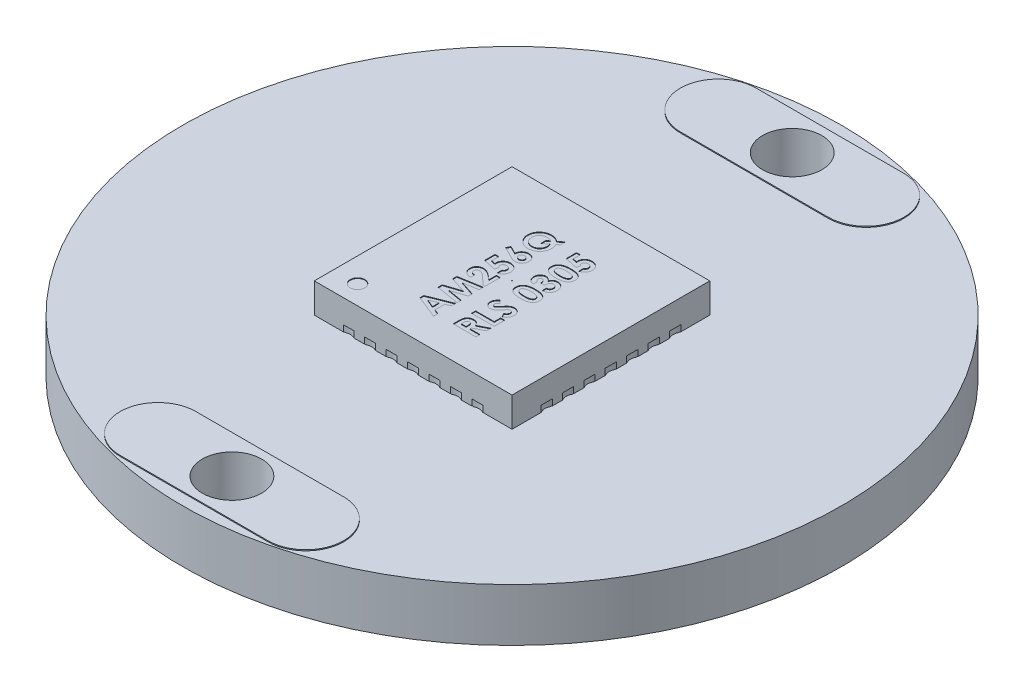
from build123d import *

# Parameters (mm, degrees)
SKETCH1_W           = 6
SKETCH1_H           = 6
SKETCH1_R           = 0.010623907
BASE_EXTRUDE_DEPTH  = 0.9
SKETCH2_W           = 4.4
SKETCH2_H           = 4.4
SKETCH2_R           = 0.005
SKETCH2_W_2         = 0.5
SKETCH2_H_2         = 0.3
SKETCH2_W_3         = 0.3
SKETCH2_H_3         = 0.5
SKETCH2_W_4         = 0.4
SKETCH2_H_4         = 0.4
BOSS_EXTRUDE1_DEPTH = 0.01
SKETCH3_R           = 0.3
CUT_EXTRUDE1_DEPTH  = 0.2
CUT_EXTRUDE2_DEPTH  = 0.02
SKETCH5_R           = 0.22
CUT_EXTRUDE3_DEPTH  = 0.02
SKETCH6_W           = 3
SKETCH6_H           = 3
CUT_EXTRUDE4_DEPTH  = 0.55
SKETCH7_W           = 4.4
SKETCH7_H           = 4.4
BOSS_EXTRUDE2_DEPTH = 0.3
SKETCH9_R           = 10
SKETCH9_R_2         = 0.9
BOSS_EXTRUDE3_DEPTH = 1.6
SKETCH11_R          = 0.9
SKETCH11_W          = 2.5
SKETCH11_H          = 0.9
BOSS_EXTRUDE5_DEPTH = 0.03
SKETCH13_W          = 2
SKETCH13_H          = 1.25
BOSS_EXTRUDE7_DEPTH = 0.5
SKETCH14_W          = 1.5
SKETCH14_H          = 3
BOSS_EXTRUDE8_DEPTH = 1.8
SKETCH15_W          = 1.5
SKETCH15_H          = 0.111896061
CUT_EXTRUDE5_DEPTH  = 0.01
BOSS_EXTRUDE9_START = 0.03
SKETCH16_R          = 0.9
BOSS_EXTRUDE9_DEPTH = 0.03


with BuildPart() as part:
    # Sketch1 → Base-Extrude (new body)
    with BuildSketch(Plane(origin=(0, 0, 0), x_dir=(1, 0, 0), z_dir=(0, 1, 0))):
        with Locations((3, 3)):
            Rectangle(SKETCH1_W, SKETCH1_H)
        with Locations(Location((3, 3, 0), (0, 0, 270))):
            Circle(SKETCH1_R, mode=Mode.SUBTRACT)
    extrude(amount=BASE_EXTRUDE_DEPTH)

    # Sketch2 → Boss-Extrude1 (add)
    # profile 1 of 30: a face of its own
    with BuildSketch(Plane.XZ):
        with Locations((3.000818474, -3)):
            Rectangle(SKETCH2_W, SKETCH2_H)
        with Locations(Location((3, -3, 0), (0, 0, 270))):
            Circle(SKETCH2_R, mode=Mode.SUBTRACT)
    # profile 2 of 30: a face of its own
    with BuildSketch(Plane.XZ):
        with Locations((0.250818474, -3.65)):
            Rectangle(SKETCH2_W_2, SKETCH2_H_2)
    # profile 3 of 30: a face of its own
    with BuildSketch(Plane.XZ):
        with Locations((1.700818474, -5.75)):
            Rectangle(SKETCH2_W_3, SKETCH2_H_3)
    # profile 4 of 30: a face of its own
    with BuildSketch(Plane.XZ):
        with Locations((1.050818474, -5.75)):
            Rectangle(SKETCH2_W_3, SKETCH2_H_3)
    # profile 5 of 30: a face of its own
    with BuildSketch(Plane.XZ):
        with Locations((0.250818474, -4.95)):
            Rectangle(SKETCH2_W_2, SKETCH2_H_2)
    # profile 6 of 30: a face of its own
    with BuildSketch(Plane.XZ):
        with Locations((0.250818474, -4.3)):
            Rectangle(SKETCH2_W_2, SKETCH2_H_2)
    # profile 7 of 30: a face of its own
    with BuildSketch(Plane.XZ):
        with Locations((5.67, -0.316672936)):
            Rectangle(SKETCH2_W_4, SKETCH2_H_4)
    # profile 8 of 30: a face of its own
    with BuildSketch(Plane.XZ):
        with Locations((1.050818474, -0.25)):
            Rectangle(SKETCH2_W_3, SKETCH2_H_3)
    # profile 9 of 30: a face of its own
    with BuildSketch(Plane.XZ):
        with Locations((1.700818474, -0.25)):
            Rectangle(SKETCH2_W_3, SKETCH2_H_3)
    # profile 10 of 30: a face of its own
    with BuildSketch(Plane.XZ):
        with Locations((0.250818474, -1.05)):
            Rectangle(SKETCH2_W_2, SKETCH2_H_2)
    # profile 11 of 30: a face of its own
    with BuildSketch(Plane.XZ):
        with Locations((0.250818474, -1.7)):
            Rectangle(SKETCH2_W_2, SKETCH2_H_2)
    # profile 12 of 30: a face of its own
    with BuildSketch(Plane.XZ):
        with Locations((0.250818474, -2.35)):
            Rectangle(SKETCH2_W_2, SKETCH2_H_2)
    # profile 13 of 30: a face of its own
    with BuildSketch(Plane.XZ):
        with Locations((0.250818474, -3)):
            Rectangle(SKETCH2_W_2, SKETCH2_H_2)
    # profile 14 of 30: a face of its own
    with BuildSketch(Plane.XZ):
        with Locations((5.750818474, -3.65)):
            Rectangle(SKETCH2_W_2, SKETCH2_H_2)
    # profile 15 of 30: a face of its own
    with BuildSketch(Plane.XZ):
        with Locations((5.750818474, -4.3)):
            Rectangle(SKETCH2_W_2, SKETCH2_H_2)
    # profile 16 of 30: a face of its own
    with BuildSketch(Plane.XZ):
        with Locations((5.750818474, -4.95)):
            Rectangle(SKETCH2_W_2, SKETCH2_H_2)
    # profile 17 of 30: a face of its own
    with BuildSketch(Plane.XZ):
        with Locations((3.650818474, -5.75)):
            Rectangle(SKETCH2_W_3, SKETCH2_H_3)
    # profile 18 of 30: a face of its own
    with BuildSketch(Plane.XZ):
        with Locations((4.300818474, -5.75)):
            Rectangle(SKETCH2_W_3, SKETCH2_H_3)
    # profile 19 of 30: a face of its own
    with BuildSketch(Plane.XZ):
        with Locations((4.950818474, -5.75)):
            Rectangle(SKETCH2_W_3, SKETCH2_H_3)
    # profile 20 of 30: a face of its own
    with BuildSketch(Plane.XZ):
        with Locations((3.000818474, -5.75)):
            Rectangle(SKETCH2_W_3, SKETCH2_H_3)
    # profile 21 of 30: a face of its own
    with BuildSketch(Plane.XZ):
        with Locations((2.350818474, -5.75)):
            Rectangle(SKETCH2_W_3, SKETCH2_H_3)
    # profile 22 of 30: a face of its own
    with BuildSketch(Plane.XZ):
        with Locations((5.750818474, -1.05)):
            Rectangle(SKETCH2_W_2, SKETCH2_H_2)
    # profile 23 of 30: a face of its own
    with BuildSketch(Plane.XZ):
        with Locations((5.750818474, -3)):
            Rectangle(SKETCH2_W_2, SKETCH2_H_2)
    # profile 24 of 30: a face of its own
    with BuildSketch(Plane.XZ):
        with Locations((5.750818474, -2.35)):
            Rectangle(SKETCH2_W_2, SKETCH2_H_2)
    # profile 25 of 30: a face of its own
    with BuildSketch(Plane.XZ):
        with Locations((5.750818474, -1.7)):
            Rectangle(SKETCH2_W_2, SKETCH2_H_2)
    # profile 26 of 30: a face of its own
    with BuildSketch(Plane.XZ):
        with Locations((2.350818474, -0.25)):
            Rectangle(SKETCH2_W_3, SKETCH2_H_3)
    # profile 27 of 30: a face of its own
    with BuildSketch(Plane.XZ):
        with Locations((4.950818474, -0.25)):
            Rectangle(SKETCH2_W_3, SKETCH2_H_3)
    # profile 28 of 30: a face of its own
    with BuildSketch(Plane.XZ):
        with Locations((4.300818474, -0.25)):
            Rectangle(SKETCH2_W_3, SKETCH2_H_3)
    # profile 29 of 30: a face of its own
    with BuildSketch(Plane.XZ):
        with Locations((3.650818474, -0.25)):
            Rectangle(SKETCH2_W_3, SKETCH2_H_3)
    # profile 30 of 30: a face of its own
    with BuildSketch(Plane.XZ):
        with Locations((3.000818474, -0.25)):
            Rectangle(SKETCH2_W_3, SKETCH2_H_3)
    extrude(amount=BOSS_EXTRUDE1_DEPTH)

    # Sketch3 → Cut-Extrude1 (cut)
    with BuildSketch(Plane.XZ.offset(0.01)):
        with Locations((4.945893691, 0.25)):
            Circle(SKETCH3_R)
        with Locations((4.295893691, 0.25)):
            Circle(SKETCH3_R)
        with Locations((3.645893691, 0.25)):
            Circle(SKETCH3_R)
        with Locations((2.995893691, 0.25)):
            Circle(SKETCH3_R)
        with Locations((2.345893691, 0.25)):
            Circle(SKETCH3_R)
        with Locations((1.695893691, 0.25)):
            Circle(SKETCH3_R)
        with Locations((1.045893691, 0.25)):
            Circle(SKETCH3_R)
        with Locations((4.945893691, -6.25)):
            Circle(SKETCH3_R)
        with Locations((4.295893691, -6.25)):
            Circle(SKETCH3_R)
        with Locations((3.645893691, -6.25)):
            Circle(SKETCH3_R)
        with Locations((2.995893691, -6.25)):
            Circle(SKETCH3_R)
        with Locations((2.345893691, -6.25)):
            Circle(SKETCH3_R)
        with Locations((1.695893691, -6.25)):
            Circle(SKETCH3_R)
        with Locations((1.045893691, -6.25)):
            Circle(SKETCH3_R)
        with Locations((-0.254106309, -1.05)):
            Circle(SKETCH3_R)
        with Locations((6.245893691, -1.7)):
            Circle(SKETCH3_R)
        with Locations((6.245893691, -1.05)):
            Circle(SKETCH3_R)
        with Locations((-0.254106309, -1.7)):
            Circle(SKETCH3_R)
        with Locations((6.245893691, -2.35)):
            Circle(SKETCH3_R)
        with Locations((-0.254106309, -2.35)):
            Circle(SKETCH3_R)
        with Locations((6.245893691, -3)):
            Circle(SKETCH3_R)
        with Locations((-0.254106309, -3)):
            Circle(SKETCH3_R)
        with Locations((6.245893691, -3.65)):
            Circle(SKETCH3_R)
        with Locations((-0.254106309, -3.65)):
            Circle(SKETCH3_R)
        with Locations((6.245893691, -4.3)):
            Circle(SKETCH3_R)
        with Locations((-0.254106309, -4.3)):
            Circle(SKETCH3_R)
        with Locations((6.245893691, -4.95)):
            Circle(SKETCH3_R)
        with Locations((-0.254106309, -4.95)):
            Circle(SKETCH3_R)
    extrude(amount=-CUT_EXTRUDE1_DEPTH, mode=Mode.SUBTRACT)

    # Sketch4 → Cut-Extrude2 (cut)
    # profile 1 of 13: a face of its own
    with BuildSketch(Plane(origin=(0, 0.9, 0), x_dir=(-1, 0, 0), z_dir=(0, 1, 0))):
        Polygon((-2.045639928, -1.161083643), (-2.045639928, -1.275598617), (-2.733556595, -1.553411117), (-2.733556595, -1.421532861), (-2.592445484, -1.368064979), (-2.592445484, -1.068341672), (-2.733556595, -1.01487379), (-2.733556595, -0.883133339), align=None)
        Polygon((-2.230159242, -1.218272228), (-2.468973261, -1.115194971), (-2.468973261, -1.321349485), align=None, mode=Mode.SUBTRACT)
    # profile 2 of 13: a face of its own
    with BuildSketch(Plane(origin=(0, 0.9, 0), x_dir=(-1, 0, 0), z_dir=(0, 1, 0))):
        Polygon((-2.045639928, -1.709267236), (-2.045639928, -1.837424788), (-2.525472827, -1.994383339), (-2.045639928, -2.15244432), (-2.045639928, -2.279361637), (-2.733556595, -2.395668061), (-2.733556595, -2.270679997), (-2.299061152, -2.197230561), (-2.733556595, -2.054190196), (-2.733556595, -1.933749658), (-2.299061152, -1.791536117), (-2.733556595, -1.718224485), (-2.733556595, -1.593098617), align=None)
    # profile 3 of 13: a face of its own
    with BuildSketch(Plane(origin=(0, 0.9, 0), x_dir=(-1, 0, 0), z_dir=(0, 1, 0))):
        with BuildLine():
            Line((-2.274945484, -2.589695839), (-2.274945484, -2.466223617))
            add(Edge.make_bspline(
                [(-2.274945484, -2.466223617), (-2.265605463, -2.466756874), (-2.247355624, -2.467798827), (-2.220847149, -2.471943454), (-2.195799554, -2.477497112), (-2.17230046, -2.484909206), (-2.150358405, -2.494222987), (-2.129898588, -2.505198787), (-2.111028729, -2.518117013), (-2.093839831, -2.532702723), (-2.078419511, -2.548708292), (-2.064746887, -2.565801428), (-2.053464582, -2.584243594), (-2.044180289, -2.603697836), (-2.036762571, -2.624160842), (-2.031803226, -2.645826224), (-2.028444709, -2.668506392), (-2.028150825, -2.684032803), (-2.028001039, -2.691946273)],
                knots=[0, 0, 0, 0, 1.199038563, 2.342849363, 3.436047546, 4.486744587, 5.497670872, 6.488682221, 7.459191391, 8.424610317, 9.374430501, 10.305433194, 11.225809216, 12.140057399, 13.06607119, 14.010487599, 14.985989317, 16, 16, 16, 16], degree=3))
            add(Edge.make_bspline(
                [(-2.028001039, -2.691946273), (-2.028304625, -2.701659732), (-2.028897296, -2.72062268), (-2.033937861, -2.748180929), (-2.042418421, -2.773942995), (-2.054149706, -2.797909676), (-2.069122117, -2.819793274), (-2.087130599, -2.839451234), (-2.108112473, -2.856760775), (-2.131639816, -2.871390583), (-2.156591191, -2.883347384), (-2.182286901, -2.891898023), (-2.208191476, -2.897481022), (-2.225630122, -2.89807922), (-2.234293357, -2.898376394)],
                knots=[0, 0, 0, 0, 1.075208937, 2.099059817, 3.090102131, 4.070747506, 5.044426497, 6.016695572, 7.013986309, 8.047248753, 9.078128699, 10.07077592, 11.041593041, 12, 12, 12, 12], degree=3))
            add(Edge.make_bspline(
                [(-2.234293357, -2.898376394), (-2.239533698, -2.898260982), (-2.250081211, -2.898028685), (-2.266042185, -2.896413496), (-2.282300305, -2.893990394), (-2.298841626, -2.890336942), (-2.315670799, -2.885780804), (-2.332838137, -2.88025349), (-2.350246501, -2.87362707), (-2.368091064, -2.866011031), (-2.386432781, -2.856928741), (-2.405534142, -2.846338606), (-2.425451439, -2.834021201), (-2.446039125, -2.81984281), (-2.467743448, -2.804378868), (-2.490005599, -2.78689597), (-2.513190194, -2.767905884), (-2.528677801, -2.754413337), (-2.536634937, -2.747481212)],
                knots=[0, 0, 0, 0, 0.728291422, 1.465870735, 2.227967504, 3.011895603, 3.818808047, 4.650669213, 5.517493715, 6.406970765, 7.346374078, 8.360901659, 9.441709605, 10.599840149, 11.834858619, 13.145178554, 14.533265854, 16, 16, 16, 16], degree=3))
            Line((-2.536634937, -2.747481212), (-2.618903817, -2.675685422))
            Line((-2.618903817, -2.675685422), (-2.618903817, -2.907195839))
            Line((-2.618903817, -2.907195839), (-2.733556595, -2.907195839))
            Line((-2.733556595, -2.907195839), (-2.733556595, -2.448584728))
            Line((-2.733556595, -2.448584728), (-2.670993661, -2.448584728))
            Line((-2.670993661, -2.448584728), (-2.454228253, -2.652258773))
            add(Edge.make_bspline(
                [(-2.454228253, -2.652258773), (-2.447905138, -2.65815566), (-2.435659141, -2.669576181), (-2.417674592, -2.685826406), (-2.400607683, -2.700531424), (-2.384276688, -2.713386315), (-2.369211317, -2.725065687), (-2.354957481, -2.735048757), (-2.34164404, -2.743426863), (-2.325590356, -2.752522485), (-2.30644348, -2.761160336), (-2.284385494, -2.769086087), (-2.26330314, -2.773917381), (-2.249565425, -2.774584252), (-2.242974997, -2.774904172)],
                knots=[0, 0, 0, 0, 1.246127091, 2.413378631, 3.493388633, 4.492180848, 5.408488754, 6.240484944, 6.999099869, 7.674939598, 8.898438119, 10.020720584, 11.050475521, 12, 12, 12, 12], degree=3))
            add(Edge.make_bspline(
                [(-2.242974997, -2.774904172), (-2.236597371, -2.774668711), (-2.224239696, -2.774212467), (-2.206712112, -2.769073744), (-2.190722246, -2.761384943), (-2.176998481, -2.750222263), (-2.165622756, -2.736749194), (-2.157286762, -2.721091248), (-2.152387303, -2.703535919), (-2.151783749, -2.691242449), (-2.151473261, -2.684918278)],
                knots=[0, 0, 0, 0, 1.061596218, 2.057012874, 3.024113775, 4.006148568, 4.986025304, 5.949989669, 6.945406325, 8, 8, 8, 8], degree=3))
            add(Edge.make_bspline(
                [(-2.151473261, -2.684918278), (-2.151588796, -2.681651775), (-2.151816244, -2.67522114), (-2.153330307, -2.665768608), (-2.155998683, -2.656773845), (-2.159573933, -2.648136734), (-2.164312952, -2.639949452), (-2.170154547, -2.632232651), (-2.176950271, -2.624905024), (-2.184678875, -2.618000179), (-2.193303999, -2.611715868), (-2.20274687, -2.606134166), (-2.213001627, -2.601519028), (-2.223932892, -2.597455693), (-2.235658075, -2.594321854), (-2.248107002, -2.592040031), (-2.26125942, -2.590305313), (-2.270300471, -2.589902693), (-2.274945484, -2.589695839)],
                knots=[0, 0, 0, 0, 0.903469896, 1.778625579, 2.63899355, 3.493148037, 4.358286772, 5.247621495, 6.164656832, 7.118446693, 8.109501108, 9.111810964, 10.146451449, 11.215617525, 12.33435995, 13.498009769, 14.714554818, 16, 16, 16, 16], degree=3))
        make_face()
    # profile 4 of 13: a face of its own
    with BuildSketch(Plane(origin=(0, 0.9, 0), x_dir=(-1, 0, 0), z_dir=(0, 1, 0))):
        with BuildLine():
            Line((-2.045639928, -3.123134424), (-2.045639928, -3.436362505))
            Line((-2.045639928, -3.436362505), (-2.160292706, -3.436362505))
            Line((-2.160292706, -3.436362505), (-2.160292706, -3.220975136))
            Line((-2.160292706, -3.220975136), (-2.290379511, -3.194103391))
            add(Edge.make_bspline(
                [(-2.290379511, -3.194103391), (-2.289356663, -3.197764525), (-2.287327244, -3.20502853), (-2.285359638, -3.21591626), (-2.284014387, -3.226453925), (-2.283846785, -3.233327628), (-2.283764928, -3.236684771)],
                knots=[0, 0, 0, 0, 1.054652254, 2.092520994, 3.068380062, 4, 4, 4, 4], degree=3))
            add(Edge.make_bspline(
                [(-2.283764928, -3.236684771), (-2.283932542, -3.243999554), (-2.284262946, -3.258418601), (-2.287399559, -3.279511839), (-2.292339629, -3.29970986), (-2.299385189, -3.318950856), (-2.308555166, -3.337216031), (-2.319648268, -3.354527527), (-2.332683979, -3.370906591), (-2.347670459, -3.38606226), (-2.364125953, -3.399987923), (-2.381924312, -3.412095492), (-2.400811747, -3.422436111), (-2.420905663, -3.430660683), (-2.442079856, -3.437152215), (-2.464347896, -3.441843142), (-2.487736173, -3.444617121), (-2.503692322, -3.444991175), (-2.511830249, -3.44518195)],
                knots=[0, 0, 0, 0, 1.01440847, 1.999622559, 2.951875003, 3.895578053, 4.836219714, 5.782137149, 6.743708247, 7.735272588, 8.734977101, 9.730283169, 10.717124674, 11.717316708, 12.737475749, 13.78628267, 14.87096371, 16, 16, 16, 16], degree=3))
            add(Edge.make_bspline(
                [(-2.511830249, -3.44518195), (-2.520061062, -3.444950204), (-2.536302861, -3.444492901), (-2.560175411, -3.441471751), (-2.583087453, -3.436243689), (-2.604911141, -3.428701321), (-2.625832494, -3.419372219), (-2.645709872, -3.407783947), (-2.664600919, -3.394136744), (-2.682247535, -3.378462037), (-2.698379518, -3.361428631), (-2.712570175, -3.343290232), (-2.724511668, -3.32417647), (-2.73416237, -3.304086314), (-2.741797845, -3.283135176), (-2.747356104, -3.261316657), (-2.750543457, -3.238524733), (-2.750975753, -3.223051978), (-2.751195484, -3.215187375)],
                knots=[0, 0, 0, 0, 1.06812338, 2.107719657, 3.117068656, 4.112431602, 5.099639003, 6.085279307, 7.092884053, 8.119131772, 9.143854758, 10.133578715, 11.102895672, 12.062725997, 13.020721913, 13.992309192, 14.979516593, 16, 16, 16, 16], degree=3))
            add(Edge.make_bspline(
                [(-2.751195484, -3.215187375), (-2.75101573, -3.208154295), (-2.750661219, -3.19428359), (-2.748482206, -3.17385265), (-2.744629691, -3.154154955), (-2.739054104, -3.135295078), (-2.732191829, -3.117074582), (-2.723609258, -3.099704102), (-2.713469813, -3.083088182), (-2.701958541, -3.067274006), (-2.688991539, -3.052518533), (-2.674796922, -3.0390513), (-2.659553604, -3.026790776), (-2.643073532, -3.015999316), (-2.625381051, -3.006710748), (-2.606684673, -2.998473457), (-2.586789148, -2.991731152), (-2.572996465, -2.988309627), (-2.56598715, -2.986570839)],
                knots=[0, 0, 0, 0, 1.054957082, 2.080596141, 3.077793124, 4.061112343, 5.027190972, 5.994718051, 6.962465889, 7.943658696, 8.924948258, 9.904494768, 10.875059, 11.855380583, 12.854004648, 13.869083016, 14.917087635, 16, 16, 16, 16], degree=3))
            Line((-2.56598715, -2.986570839), (-2.56598715, -3.12768195))
            add(Edge.make_bspline(
                [(-2.56598715, -3.12768195), (-2.570844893, -3.130261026), (-2.580285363, -3.135273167), (-2.592809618, -3.144815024), (-2.603551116, -3.155494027), (-2.61241078, -3.16732459), (-2.619122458, -3.180138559), (-2.624259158, -3.193506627), (-2.627166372, -3.207666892), (-2.627536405, -3.21733384), (-2.627723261, -3.22221537)],
                knots=[0, 0, 0, 0, 1.105084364, 2.147605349, 3.154024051, 4.144789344, 5.108147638, 6.055727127, 7.018198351, 8, 8, 8, 8], degree=3))
            add(Edge.make_bspline(
                [(-2.627723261, -3.22221537), (-2.627595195, -3.225618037), (-2.627343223, -3.232312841), (-2.62601124, -3.242177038), (-2.623485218, -3.251591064), (-2.619998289, -3.260633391), (-2.615591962, -3.269330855), (-2.610178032, -3.277639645), (-2.603790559, -3.285518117), (-2.596532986, -3.292940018), (-2.588421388, -3.299639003), (-2.579762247, -3.30556464), (-2.570563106, -3.310633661), (-2.560722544, -3.314573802), (-2.550349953, -3.317753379), (-2.539432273, -3.320108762), (-2.527944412, -3.321513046), (-2.520102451, -3.321643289), (-2.516102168, -3.321709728)],
                knots=[0, 0, 0, 0, 0.978584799, 1.925382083, 2.854237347, 3.773848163, 4.706917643, 5.651871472, 6.619075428, 7.618203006, 8.630937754, 9.638147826, 10.630884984, 11.643619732, 12.679505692, 13.746568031, 14.850495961, 16, 16, 16, 16], degree=3))
            add(Edge.make_bspline(
                [(-2.516102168, -3.321709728), (-2.512191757, -3.321653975), (-2.504574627, -3.321545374), (-2.493450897, -3.320009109), (-2.48280204, -3.318084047), (-2.472727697, -3.314972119), (-2.463115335, -3.311175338), (-2.454187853, -3.306211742), (-2.445536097, -3.300823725), (-2.437787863, -3.294261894), (-2.430619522, -3.28732624), (-2.424361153, -3.279854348), (-2.41916443, -3.27193814), (-2.414628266, -3.263817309), (-2.41132678, -3.255169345), (-2.40905321, -3.24618828), (-2.407384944, -3.236883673), (-2.407286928, -3.230537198), (-2.40723715, -3.227314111)],
                knots=[0, 0, 0, 0, 1.166407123, 2.272056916, 3.347877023, 4.393466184, 5.414668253, 6.42708463, 7.438943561, 8.452102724, 9.450960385, 10.414941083, 11.35441816, 12.274885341, 13.186627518, 14.108013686, 15.039145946, 16, 16, 16, 16], degree=3))
            add(Edge.make_bspline(
                [(-2.40723715, -3.227314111), (-2.407369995, -3.22381309), (-2.407636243, -3.216796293), (-2.409802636, -3.206371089), (-2.413308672, -3.196071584), (-2.418145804, -3.185840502), (-2.424476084, -3.175779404), (-2.431900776, -3.165622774), (-2.440959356, -3.155710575), (-2.447706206, -3.149408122), (-2.451196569, -3.146147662)],
                knots=[0, 0, 0, 0, 0.88288272, 1.769486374, 2.674910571, 3.623812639, 4.617874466, 5.670434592, 6.794841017, 8, 8, 8, 8], degree=3))
            Line((-2.451196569, -3.146147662), (-2.427356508, -3.042243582))
            Line((-2.427356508, -3.042243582), (-2.045639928, -3.123134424))
        make_face()
    # profile 5 of 13: a face of its own
    with BuildSketch(Plane(origin=(0, 0.9, 0), x_dir=(-1, 0, 0), z_dir=(0, 1, 0))):
        with BuildLine():
            Line((-2.028001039, -3.777564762), (-2.083398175, -3.886843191))
            Line((-2.083398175, -3.886843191), (-2.319042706, -3.766953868))
            add(Edge.make_bspline(
                [(-2.319042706, -3.766953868), (-2.319226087, -3.774036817), (-2.319587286, -3.787987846), (-2.322506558, -3.808513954), (-2.32755328, -3.828137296), (-2.334242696, -3.847055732), (-2.343226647, -3.865038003), (-2.353913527, -3.882373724), (-2.366947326, -3.898614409), (-2.381388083, -3.914132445), (-2.397386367, -3.928242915), (-2.414577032, -3.940500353), (-2.432541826, -3.951182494), (-2.451682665, -3.95948636), (-2.471682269, -3.966184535), (-2.492620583, -3.971017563), (-2.514558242, -3.973774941), (-2.529461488, -3.974155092), (-2.537048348, -3.974348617)],
                knots=[0, 0, 0, 0, 1.013260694, 1.995783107, 2.958651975, 3.908806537, 4.861209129, 5.829647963, 6.817170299, 7.835534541, 8.860094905, 9.863329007, 10.853101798, 11.844815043, 12.84250023, 13.867713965, 14.914507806, 16, 16, 16, 16], degree=3))
            add(Edge.make_bspline(
                [(-2.537048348, -3.974348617), (-2.544361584, -3.974167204), (-2.558816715, -3.97380863), (-2.580048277, -3.970846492), (-2.600416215, -3.966054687), (-2.619891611, -3.959223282), (-2.638504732, -3.95048851), (-2.656432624, -3.940038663), (-2.673279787, -3.927339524), (-2.689131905, -3.912980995), (-2.70363508, -3.897269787), (-2.716386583, -3.880600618), (-2.727045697, -3.863050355), (-2.735997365, -3.84484426), (-2.742685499, -3.825653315), (-2.747731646, -3.805754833), (-2.750643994, -3.785000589), (-2.751010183, -3.77091304), (-2.751195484, -3.76378438)],
                knots=[0, 0, 0, 0, 1.049811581, 2.075027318, 3.071773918, 4.050170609, 5.032849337, 6.020452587, 7.024397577, 8.056465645, 9.088112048, 10.090756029, 11.064784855, 12.032427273, 12.998382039, 13.977467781, 14.976547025, 16, 16, 16, 16], degree=3))
            add(Edge.make_bspline(
                [(-2.751195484, -3.76378438), (-2.751043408, -3.756329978), (-2.750744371, -3.741671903), (-2.747395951, -3.720223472), (-2.742355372, -3.69965258), (-2.735158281, -3.68007484), (-2.725994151, -3.661368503), (-2.714654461, -3.643753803), (-2.701264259, -3.62708236), (-2.686124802, -3.611531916), (-2.669541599, -3.597522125), (-2.652323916, -3.585026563), (-2.634444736, -3.574455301), (-2.615923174, -3.56589811), (-2.596818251, -3.559221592), (-2.577093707, -3.554576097), (-2.556801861, -3.551549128), (-2.543030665, -3.551194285), (-2.536083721, -3.551015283)],
                knots=[0, 0, 0, 0, 1.063775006, 2.091769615, 3.092589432, 4.084662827, 5.064601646, 6.061867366, 7.070035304, 8.113879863, 9.156342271, 10.166834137, 11.149076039, 12.117706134, 13.076241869, 14.034148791, 15.008317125, 16, 16, 16, 16], degree=3))
            add(Edge.make_bspline(
                [(-2.536083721, -3.551015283), (-2.530704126, -3.551109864), (-2.51991499, -3.551299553), (-2.503758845, -3.553205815), (-2.487560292, -3.556104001), (-2.473891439, -3.559463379), (-2.462332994, -3.562922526), (-2.452551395, -3.566404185), (-2.441695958, -3.570718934), (-2.429738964, -3.575651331), (-2.416694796, -3.581356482), (-2.40259901, -3.587804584), (-2.387344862, -3.595011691), (-2.376867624, -3.600151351), (-2.371408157, -3.602829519)],
                knots=[0, 0, 0, 0, 1.110454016, 2.227089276, 3.35462975, 4.507227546, 5.131400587, 5.845402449, 6.650387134, 7.543487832, 8.516250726, 9.590168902, 10.744287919, 12, 12, 12, 12], degree=3))
            Line((-2.371408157, -3.602829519), (-2.028001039, -3.777564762))
        make_face()
        with BuildLine():
            add(Edge.make_bspline(
                [(-2.433695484, -3.761028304), (-2.433967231, -3.755103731), (-2.434499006, -3.743510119), (-2.440068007, -3.727025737), (-2.448804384, -3.711995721), (-2.460971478, -3.698967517), (-2.475511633, -3.688070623), (-2.492096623, -3.680063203), (-2.510505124, -3.675246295), (-2.523376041, -3.674745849), (-2.530020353, -3.674487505)],
                knots=[0, 0, 0, 0, 0.981744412, 1.921144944, 2.858899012, 3.85339082, 4.86292663, 5.863643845, 6.897155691, 8, 8, 8, 8], degree=3))
            add(Edge.make_bspline(
                [(-2.530020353, -3.674487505), (-2.536665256, -3.674796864), (-2.549590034, -3.675398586), (-2.568216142, -3.680353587), (-2.585109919, -3.688731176), (-2.599826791, -3.700174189), (-2.612143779, -3.713529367), (-2.621140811, -3.728464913), (-2.626704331, -3.744616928), (-2.627381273, -3.755794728), (-2.627723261, -3.761441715)],
                knots=[0, 0, 0, 0, 1.098593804, 2.136838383, 3.163662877, 4.199231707, 5.205701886, 6.153612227, 7.067210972, 8, 8, 8, 8], degree=3))
            add(Edge.make_bspline(
                [(-2.627723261, -3.761441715), (-2.627374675, -3.767405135), (-2.626691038, -3.779100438), (-2.621368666, -3.795971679), (-2.61247596, -3.811383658), (-2.600285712, -3.825010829), (-2.585720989, -3.836716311), (-2.568659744, -3.844815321), (-2.54994183, -3.850044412), (-2.536809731, -3.850592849), (-2.530020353, -3.850876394)],
                knots=[0, 0, 0, 0, 0.96921794, 1.900804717, 2.848419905, 3.844199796, 4.861108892, 5.867439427, 6.897452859, 8, 8, 8, 8], degree=3))
            add(Edge.make_bspline(
                [(-2.530020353, -3.850876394), (-2.523373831, -3.85057297), (-2.510490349, -3.849984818), (-2.492088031, -3.84501634), (-2.475462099, -3.83688269), (-2.460924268, -3.825679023), (-2.448697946, -3.812205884), (-2.440068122, -3.796510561), (-2.4344832, -3.779316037), (-2.433962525, -3.767227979), (-2.433695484, -3.761028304)],
                knots=[0, 0, 0, 0, 1.083506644, 2.10024676, 3.086160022, 4.086481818, 5.079696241, 6.033050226, 6.991198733, 8, 8, 8, 8], degree=3))
        make_face(mode=Mode.SUBTRACT)
    # profile 6 of 13: a face of its own
    with BuildSketch(Plane(origin=(0, 0.9, 0), x_dir=(-1, 0, 0), z_dir=(0, 1, 0))):
        with BuildLine():
            Line((-2.635578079, -4.71518195), (-2.786473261, -4.831901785))
            Line((-2.786473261, -4.831901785), (-2.786473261, -4.678250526))
            Line((-2.786473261, -4.678250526), (-2.708338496, -4.61775465))
            add(Edge.make_bspline(
                [(-2.708338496, -4.61775465), (-2.711788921, -4.61141789), (-2.718673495, -4.598774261), (-2.727258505, -4.578947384), (-2.734789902, -4.558753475), (-2.740691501, -4.537899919), (-2.745336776, -4.516586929), (-2.74888352, -4.494704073), (-2.750753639, -4.472267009), (-2.751047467, -4.457124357), (-2.751195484, -4.449496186)],
                knots=[0, 0, 0, 0, 0.985706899, 1.966764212, 2.949968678, 3.929638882, 4.925906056, 5.930211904, 6.957336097, 8, 8, 8, 8], degree=3))
            add(Edge.make_bspline(
                [(-2.751195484, -4.449496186), (-2.750910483, -4.436798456), (-2.75035149, -4.411893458), (-2.744984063, -4.375419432), (-2.736880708, -4.340502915), (-2.72504129, -4.307273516), (-2.70999603, -4.275619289), (-2.691351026, -4.245793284), (-2.66962322, -4.217448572), (-2.644599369, -4.191278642), (-2.617481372, -4.167333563), (-2.588670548, -4.14641129), (-2.558616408, -4.128625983), (-2.527271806, -4.114121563), (-2.494582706, -4.102842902), (-2.46063839, -4.094944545), (-2.42539195, -4.089937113), (-2.401466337, -4.089316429), (-2.389322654, -4.089001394)],
                knots=[0, 0, 0, 0, 1.070144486, 2.098953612, 3.10240755, 4.088674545, 5.067611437, 6.052256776, 7.0494179, 8.074208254, 9.100739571, 10.09639475, 11.072322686, 12.041159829, 13.004031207, 13.983083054, 14.976293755, 16, 16, 16, 16], degree=3))
            add(Edge.make_bspline(
                [(-2.389322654, -4.089001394), (-2.381186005, -4.089107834), (-2.365015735, -4.089319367), (-2.341045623, -4.091808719), (-2.317579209, -4.095506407), (-2.294608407, -4.100538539), (-2.272214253, -4.107376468), (-2.250316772, -4.115648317), (-2.228858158, -4.12533721), (-2.207969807, -4.136423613), (-2.187969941, -4.149024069), (-2.168696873, -4.162411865), (-2.150770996, -4.177304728), (-2.133785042, -4.193172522), (-2.117762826, -4.210076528), (-2.102963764, -4.228278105), (-2.089229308, -4.247533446), (-2.076550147, -4.267769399), (-2.065202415, -4.288719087), (-2.05516996, -4.310176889), (-2.046827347, -4.332074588), (-2.039822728, -4.354318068), (-2.034682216, -4.377016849), (-2.030733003, -4.400002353), (-2.028542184, -4.423454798), (-2.028182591, -4.439202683), (-2.028001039, -4.447153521)],
                knots=[0, 0, 0, 0, 1.035868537, 2.058620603, 3.065590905, 4.060526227, 5.050634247, 6.044812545, 7.039747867, 8.04732973, 9.05375611, 10.048691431, 11.033670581, 12.018736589, 13.007807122, 13.997310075, 15.003787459, 16.018274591, 17.036549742, 18.036357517, 19.032616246, 20.018845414, 21.003668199, 21.994260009, 22.987336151, 24, 24, 24, 24], degree=3))
            add(Edge.make_bspline(
                [(-2.028001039, -4.447153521), (-2.028306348, -4.459160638), (-2.028907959, -4.482820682), (-2.03405259, -4.517624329), (-2.042247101, -4.551187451), (-2.054089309, -4.583369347), (-2.069010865, -4.614375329), (-2.087530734, -4.643894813), (-2.109082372, -4.672329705), (-2.133884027, -4.698894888), (-2.160943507, -4.723253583), (-2.189689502, -4.744802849), (-2.220002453, -4.762912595), (-2.251784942, -4.777814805), (-2.28507059, -4.789228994), (-2.319789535, -4.797333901), (-2.355912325, -4.802476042), (-2.380531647, -4.803073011), (-2.393043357, -4.803376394)],
                knots=[0, 0, 0, 0, 1.015478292, 2.001001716, 2.970040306, 3.933999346, 4.897009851, 5.876290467, 6.877507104, 7.911566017, 8.946369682, 9.954562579, 10.946388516, 11.928787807, 12.919455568, 13.917801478, 14.94181223, 16, 16, 16, 16], degree=3))
            add(Edge.make_bspline(
                [(-2.393043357, -4.803376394), (-2.40458627, -4.803123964), (-2.427288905, -4.802627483), (-2.460757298, -4.798326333), (-2.493016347, -4.791537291), (-2.524088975, -4.781786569), (-2.553941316, -4.769429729), (-2.582484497, -4.754033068), (-2.610057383, -4.736278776), (-2.62702877, -4.722249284), (-2.635578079, -4.71518195)],
                knots=[0, 0, 0, 0, 1.049646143, 2.064447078, 3.064298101, 4.044929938, 5.022708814, 5.998521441, 6.991758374, 8, 8, 8, 8], degree=3))
        make_face()
        with BuildLine():
            add(Edge.make_bspline(
                [(-2.530571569, -4.634153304), (-2.525302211, -4.637828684), (-2.514884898, -4.645094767), (-2.498361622, -4.654288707), (-2.481516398, -4.662186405), (-2.46426083, -4.668717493), (-2.446496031, -4.673685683), (-2.428337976, -4.677216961), (-2.409778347, -4.679555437), (-2.397276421, -4.679787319), (-2.3909763, -4.679904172)],
                knots=[0, 0, 0, 0, 1.031533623, 2.039301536, 3.033003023, 4.018477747, 4.999688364, 5.992485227, 6.988348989, 8, 8, 8, 8], degree=3))
            add(Edge.make_bspline(
                [(-2.3909763, -4.679904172), (-2.382789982, -4.67968669), (-2.366676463, -4.67925861), (-2.342989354, -4.676043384), (-2.320288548, -4.670657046), (-2.298518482, -4.663146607), (-2.277623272, -4.653688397), (-2.257776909, -4.641806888), (-2.238876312, -4.627847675), (-2.221103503, -4.61194551), (-2.204837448, -4.594632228), (-2.190511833, -4.576219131), (-2.178426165, -4.556832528), (-2.168667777, -4.536461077), (-2.160808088, -4.515325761), (-2.155532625, -4.493199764), (-2.152073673, -4.470275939), (-2.151675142, -4.454653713), (-2.151473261, -4.44674011)],
                knots=[0, 0, 0, 0, 1.056263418, 2.079093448, 3.078410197, 4.062632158, 5.04680056, 6.032966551, 7.041959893, 8.074807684, 9.106532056, 10.103754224, 11.080880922, 12.048629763, 13.014470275, 13.984975, 14.979267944, 16, 16, 16, 16], degree=3))
            add(Edge.make_bspline(
                [(-2.151473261, -4.44674011), (-2.151686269, -4.438598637), (-2.152105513, -4.422574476), (-2.155382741, -4.399049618), (-2.160523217, -4.376484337), (-2.168070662, -4.354997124), (-2.177580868, -4.334523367), (-2.189249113, -4.315062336), (-2.203145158, -4.296717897), (-2.218845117, -4.279422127), (-2.236338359, -4.263847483), (-2.254892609, -4.249851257), (-2.274940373, -4.238532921), (-2.295824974, -4.228801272), (-2.318073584, -4.221612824), (-2.341325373, -4.216139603), (-2.365818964, -4.213158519), (-2.38247105, -4.21270517), (-2.3909763, -4.212473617)],
                knots=[0, 0, 0, 0, 1.042541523, 2.051944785, 3.036764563, 4.002557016, 4.96338965, 5.924060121, 6.903168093, 7.906930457, 8.911106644, 9.899645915, 10.877621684, 11.854481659, 12.84623786, 13.866778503, 14.910431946, 16, 16, 16, 16], degree=3))
            add(Edge.make_bspline(
                [(-2.3909763, -4.212473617), (-2.400405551, -4.212752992), (-2.418885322, -4.213300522), (-2.445842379, -4.217154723), (-2.471303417, -4.223744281), (-2.495130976, -4.233275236), (-2.517660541, -4.245052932), (-2.538412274, -4.259890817), (-2.557796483, -4.27714455), (-2.569079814, -4.290463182), (-2.574806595, -4.297222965)],
                knots=[0, 0, 0, 0, 1.078047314, 2.112794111, 3.106520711, 4.077995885, 5.041371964, 6.006121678, 6.988020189, 8, 8, 8, 8], degree=3))
            add(Edge.make_bspline(
                [(-2.574806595, -4.297222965), (-2.579045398, -4.302753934), (-2.587451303, -4.313722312), (-2.598099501, -4.331289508), (-2.607298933, -4.349269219), (-2.614789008, -4.367848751), (-2.620577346, -4.387040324), (-2.624683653, -4.406775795), (-2.627268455, -4.427057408), (-2.627570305, -4.440760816), (-2.627723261, -4.447704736)],
                knots=[0, 0, 0, 0, 1.027432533, 2.037485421, 3.025540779, 4.00463061, 4.988703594, 5.97891808, 6.97585834, 8, 8, 8, 8], degree=3))
            add(Edge.make_bspline(
                [(-2.627723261, -4.447704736), (-2.627469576, -4.455671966), (-2.626966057, -4.47148545), (-2.62257996, -4.494761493), (-2.616020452, -4.517439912), (-2.609315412, -4.531657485), (-2.605950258, -4.538793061)],
                knots=[0, 0, 0, 0, 1.010952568, 2.006554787, 2.999521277, 4, 4, 4, 4], degree=3))
            Line((-2.605950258, -4.538793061), (-2.451334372, -4.41931715))
            Line((-2.451334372, -4.41931715), (-2.451334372, -4.572968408))
            Line((-2.451334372, -4.572968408), (-2.530571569, -4.634153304))
        make_face(mode=Mode.SUBTRACT)
    # profile 7 of 13: a face of its own
    with BuildSketch(Plane(origin=(0, 0.9, 0), x_dir=(-1, 0, 0), z_dir=(0, 1, 0))):
        with BuildLine():
            Line((-3.236264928, -0.980147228), (-3.236264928, -1.124014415))
            add(Edge.make_bspline(
                [(-3.236264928, -1.124014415), (-3.236298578, -1.133524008), (-3.236363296, -1.151813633), (-3.237388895, -1.17818603), (-3.238809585, -1.202413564), (-3.24100415, -1.224573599), (-3.243841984, -1.244578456), (-3.247284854, -1.262470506), (-3.25117436, -1.278260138), (-3.255941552, -1.292160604), (-3.261431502, -1.304670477), (-3.267628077, -1.316298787), (-3.274765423, -1.327250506), (-3.282554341, -1.337726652), (-3.2912738, -1.347540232), (-3.30085314, -1.356664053), (-3.311223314, -1.365215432), (-3.322321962, -1.373205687), (-3.334133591, -1.380316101), (-3.346490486, -1.386615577), (-3.359426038, -1.391791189), (-3.372866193, -1.396100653), (-3.386827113, -1.399418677), (-3.401299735, -1.401671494), (-3.416290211, -1.403337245), (-3.426475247, -1.403432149), (-3.431670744, -1.403480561)],
                knots=[0, 0, 0, 0, 1.749037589, 3.363891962, 4.853828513, 6.212420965, 7.458679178, 8.568887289, 9.562757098, 10.447168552, 11.268163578, 12.073310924, 12.867792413, 13.67045336, 14.472446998, 15.279188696, 16.101356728, 16.943088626, 17.792208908, 18.634830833, 19.491484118, 20.351879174, 21.228996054, 22.12769993, 23.044919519, 24, 24, 24, 24], degree=3))
            add(Edge.make_bspline(
                [(-3.431670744, -1.403480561), (-3.437093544, -1.403353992), (-3.447726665, -1.403105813), (-3.463345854, -1.401768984), (-3.478289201, -1.399325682), (-3.492512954, -1.395624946), (-3.506194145, -1.39137143), (-3.519080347, -1.385715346), (-3.531358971, -1.379331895), (-3.542856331, -1.371750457), (-3.553827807, -1.3634302), (-3.56385304, -1.353753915), (-3.573470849, -1.343348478), (-3.582078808, -1.331628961), (-3.590258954, -1.319111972), (-3.597672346, -1.30554881), (-3.604505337, -1.291027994), (-3.608315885, -1.280819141), (-3.610264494, -1.275598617)],
                knots=[0, 0, 0, 0, 1.099860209, 2.156625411, 3.176576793, 4.16617041, 5.135385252, 6.078461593, 7.016046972, 7.938469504, 8.868247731, 9.803980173, 10.76021508, 11.73834243, 12.748633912, 13.790971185, 14.870363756, 16, 16, 16, 16], degree=3))
            Line((-3.610264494, -1.275598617), (-3.924181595, -1.434348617))
            Line((-3.924181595, -1.434348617), (-3.924181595, -1.297096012))
            Line((-3.924181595, -1.297096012), (-3.624320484, -1.145511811))
            Line((-3.624320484, -1.145511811), (-3.624320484, -1.10361945))
            Line((-3.624320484, -1.10361945), (-3.924181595, -1.10361945))
            Line((-3.924181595, -1.10361945), (-3.924181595, -0.980147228))
            Line((-3.924181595, -0.980147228), (-3.236264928, -0.980147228))
        make_face()
        with BuildLine():
            Line((-3.500848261, -1.10361945), (-3.500848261, -1.151712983))
            add(Edge.make_bspline(
                [(-3.500848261, -1.151712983), (-3.50078204, -1.157592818), (-3.500655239, -1.168851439), (-3.500067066, -1.185042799), (-3.498649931, -1.199748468), (-3.496859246, -1.213031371), (-3.494792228, -1.224959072), (-3.491828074, -1.235422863), (-3.488657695, -1.244591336), (-3.484698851, -1.252332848), (-3.480275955, -1.25897401), (-3.475029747, -1.264540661), (-3.469282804, -1.26944468), (-3.462673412, -1.273291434), (-3.455472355, -1.276399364), (-3.447544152, -1.278326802), (-3.439032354, -1.279856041), (-3.433102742, -1.279956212), (-3.430017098, -1.280008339)],
                knots=[0, 0, 0, 0, 1.688935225, 3.233948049, 4.651771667, 5.929878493, 7.083962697, 8.124219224, 9.050753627, 9.864999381, 10.615157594, 11.334035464, 12.05533055, 12.777108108, 13.522027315, 14.29964284, 15.115170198, 16, 16, 16, 16], degree=3))
            add(Edge.make_bspline(
                [(-3.430017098, -1.280008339), (-3.426371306, -1.279868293), (-3.419209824, -1.279593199), (-3.408899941, -1.276863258), (-3.399356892, -1.272518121), (-3.390626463, -1.266560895), (-3.382964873, -1.259063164), (-3.376266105, -1.250473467), (-3.370845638, -1.240665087), (-3.367374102, -1.231518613), (-3.365240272, -1.223139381), (-3.363725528, -1.215601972), (-3.362551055, -1.206849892), (-3.361414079, -1.196931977), (-3.36063147, -1.185805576), (-3.360077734, -1.173491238), (-3.35984797, -1.159982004), (-3.359775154, -1.150564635), (-3.35973715, -1.145649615)],
                knots=[0, 0, 0, 0, 1.020213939, 2.004021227, 2.966357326, 3.948562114, 4.950324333, 5.960000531, 6.991850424, 8.080015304, 8.69218159, 9.414443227, 10.233931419, 11.166782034, 12.212677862, 13.359889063, 14.622099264, 16, 16, 16, 16], degree=3))
            Line((-3.35973715, -1.145649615), (-3.35973715, -1.10361945))
            Line((-3.35973715, -1.10361945), (-3.500848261, -1.10361945))
        make_face(mode=Mode.SUBTRACT)
    # profile 8 of 13: a face of its own
    with BuildSketch(Plane(origin=(0, 0.9, 0), x_dir=(-1, 0, 0), z_dir=(0, 1, 0))):
        Polygon((-3.236264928, -1.535772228), (-3.236264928, -1.65924445), (-3.800709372, -1.65924445), (-3.800709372, -1.853272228), (-3.924181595, -1.853272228), (-3.924181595, -1.535772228), align=None)
    # profile 9 of 13: a face of its own
    with BuildSketch(Plane(origin=(0, 0.9, 0), x_dir=(-1, 0, 0), z_dir=(0, 1, 0))):
        with BuildLine():
            Line((-3.328180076, -2.311883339), (-3.412653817, -2.21955478))
            add(Edge.make_bspline(
                [(-3.412653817, -2.21955478), (-3.407073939, -2.215600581), (-3.39636135, -2.208009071), (-3.382032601, -2.195691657), (-3.369728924, -2.18344783), (-3.359802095, -2.171027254), (-3.351810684, -2.158643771), (-3.346298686, -2.146034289), (-3.342753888, -2.133343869), (-3.342314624, -2.124813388), (-3.342098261, -2.120611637)],
                knots=[0, 0, 0, 0, 1.299459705, 2.494781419, 3.587730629, 4.594196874, 5.512431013, 6.380462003, 7.202284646, 8, 8, 8, 8], degree=3))
            add(Edge.make_bspline(
                [(-3.342098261, -2.120611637), (-3.342235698, -2.116692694), (-3.342501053, -2.109126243), (-3.345138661, -2.098339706), (-3.349690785, -2.088763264), (-3.35564307, -2.080406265), (-3.362814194, -2.073786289), (-3.370334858, -2.068500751), (-3.378635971, -2.065524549), (-3.38433751, -2.065132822), (-3.38716011, -2.064938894)],
                knots=[0, 0, 0, 0, 1.185010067, 2.2879431, 3.333075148, 4.379039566, 5.372662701, 6.27520591, 7.14612461, 8, 8, 8, 8], degree=3))
            add(Edge.make_bspline(
                [(-3.38716011, -2.064938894), (-3.390023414, -2.065060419), (-3.395789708, -2.065305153), (-3.404240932, -2.067668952), (-3.412498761, -2.071231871), (-3.417525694, -2.074636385), (-3.420095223, -2.076376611)],
                knots=[0, 0, 0, 0, 0.967525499, 1.948461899, 2.951351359, 4, 4, 4, 4], degree=3))
            add(Edge.make_bspline(
                [(-3.420095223, -2.076376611), (-3.422092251, -2.077958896), (-3.426689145, -2.081601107), (-3.433976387, -2.088539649), (-3.442843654, -2.097265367), (-3.453242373, -2.107957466), (-3.465037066, -2.120602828), (-3.478296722, -2.135313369), (-3.493104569, -2.151881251), (-3.503430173, -2.163643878), (-3.508840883, -2.169807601)],
                knots=[0, 0, 0, 0, 0.473868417, 1.090782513, 1.870421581, 2.78911798, 3.865477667, 5.087766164, 6.473963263, 8, 8, 8, 8], degree=3))
            add(Edge.make_bspline(
                [(-3.508840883, -2.169807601), (-3.513848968, -2.175594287), (-3.523353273, -2.186576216), (-3.536843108, -2.202201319), (-3.548979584, -2.215933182), (-3.559580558, -2.227971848), (-3.568757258, -2.238134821), (-3.576553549, -2.246464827), (-3.582817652, -2.253063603), (-3.586601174, -2.25681462), (-3.588215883, -2.258415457)],
                knots=[0, 0, 0, 0, 1.543621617, 2.929473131, 4.163658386, 5.240097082, 6.164993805, 6.925417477, 7.541396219, 8, 8, 8, 8], degree=3))
            add(Edge.make_bspline(
                [(-3.588215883, -2.258415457), (-3.594786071, -2.264492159), (-3.60741628, -2.276173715), (-3.627047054, -2.291316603), (-3.646079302, -2.303969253), (-3.665097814, -2.313655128), (-3.684331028, -2.320745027), (-3.704110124, -2.325937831), (-3.724774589, -2.329004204), (-3.738871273, -2.329348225), (-3.746001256, -2.329522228)],
                knots=[0, 0, 0, 0, 1.20648512, 2.3192881, 3.339983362, 4.284774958, 5.190427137, 6.099526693, 7.038756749, 8, 8, 8, 8], degree=3))
            add(Edge.make_bspline(
                [(-3.746001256, -2.329522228), (-3.75294885, -2.329399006), (-3.766580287, -2.329157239), (-3.786528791, -2.326199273), (-3.805616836, -2.321975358), (-3.823653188, -2.315466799), (-3.840851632, -2.307467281), (-3.857217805, -2.297717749), (-3.872370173, -2.285798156), (-3.886715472, -2.272558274), (-3.899598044, -2.257687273), (-3.910932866, -2.241686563), (-3.920578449, -2.224586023), (-3.928217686, -2.206321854), (-3.934352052, -2.187005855), (-3.938711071, -2.166613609), (-3.941404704, -2.145121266), (-3.941679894, -2.130449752), (-3.941820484, -2.122954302)],
                knots=[0, 0, 0, 0, 1.043082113, 2.046565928, 3.024368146, 3.976196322, 4.921091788, 5.871642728, 6.831173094, 7.81279273, 8.801063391, 9.781590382, 10.755046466, 11.74476232, 12.751114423, 13.796272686, 14.874149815, 16, 16, 16, 16], degree=3))
            add(Edge.make_bspline(
                [(-3.941820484, -2.122954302), (-3.941716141, -2.117070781), (-3.941509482, -2.105418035), (-3.939821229, -2.088243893), (-3.937099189, -2.071659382), (-3.933188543, -2.055687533), (-3.928278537, -2.040281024), (-3.922168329, -2.025454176), (-3.914976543, -2.011222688), (-3.906699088, -1.997494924), (-3.897093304, -1.984365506), (-3.886358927, -1.971657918), (-3.874263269, -1.959530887), (-3.861042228, -1.947735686), (-3.846356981, -1.936689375), (-3.830631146, -1.925825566), (-3.813494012, -1.915670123), (-3.801474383, -1.909394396), (-3.795335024, -1.906188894)],
                knots=[0, 0, 0, 0, 1.016957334, 2.014158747, 2.980235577, 3.920141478, 4.854360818, 5.773095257, 6.689355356, 7.608638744, 8.541033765, 9.498850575, 10.481527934, 11.499755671, 12.559141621, 13.65604909, 14.802761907, 16, 16, 16, 16], degree=3))
            Line((-3.795335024, -1.906188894), (-3.730153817, -2.014778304))
            add(Edge.make_bspline(
                [(-3.730153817, -2.014778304), (-3.737123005, -2.018787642), (-3.750483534, -2.026473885), (-3.768435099, -2.039498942), (-3.783807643, -2.052842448), (-3.796329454, -2.066812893), (-3.806167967, -2.081240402), (-3.813199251, -2.096194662), (-3.817551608, -2.11168618), (-3.818083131, -2.122238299), (-3.818348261, -2.127501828)],
                knots=[0, 0, 0, 0, 1.283663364, 2.460892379, 3.537111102, 4.529833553, 5.449777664, 6.316464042, 7.160231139, 8, 8, 8, 8], degree=3))
            add(Edge.make_bspline(
                [(-3.818348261, -2.127501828), (-3.818133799, -2.132856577), (-3.81771771, -2.143245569), (-3.813798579, -2.158098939), (-3.80778323, -2.171776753), (-3.79903483, -2.1835362), (-3.789059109, -2.193522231), (-3.777808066, -2.200681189), (-3.765780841, -2.205324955), (-3.757388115, -2.205807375), (-3.753167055, -2.206050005)],
                knots=[0, 0, 0, 0, 1.13537643, 2.202795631, 3.242191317, 4.290390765, 5.297919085, 6.223733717, 7.106639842, 8, 8, 8, 8], degree=3))
            add(Edge.make_bspline(
                [(-3.753167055, -2.206050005), (-3.749242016, -2.205822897), (-3.741268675, -2.205361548), (-3.729406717, -2.201981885), (-3.717602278, -2.196654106), (-3.707817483, -2.190539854), (-3.699661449, -2.184165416), (-3.692700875, -2.177917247), (-3.68484976, -2.170512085), (-3.676322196, -2.161761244), (-3.666954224, -2.151834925), (-3.656768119, -2.140700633), (-3.645846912, -2.12823846), (-3.638407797, -2.119429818), (-3.634517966, -2.114823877)],
                knots=[0, 0, 0, 0, 0.916057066, 1.860882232, 2.859899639, 3.934694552, 4.546382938, 5.276161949, 6.118633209, 7.067046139, 8.129668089, 9.306861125, 10.591787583, 12, 12, 12, 12], degree=3))
            add(Edge.make_bspline(
                [(-3.634517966, -2.114823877), (-3.627109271, -2.106068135), (-3.612889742, -2.089263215), (-3.591892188, -2.065511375), (-3.572253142, -2.04412415), (-3.553816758, -2.025242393), (-3.536696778, -2.008815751), (-3.52105629, -1.994645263), (-3.50657799, -1.983039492), (-3.489400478, -1.970838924), (-3.468578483, -1.959060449), (-3.443393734, -1.949070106), (-3.418265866, -1.942552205), (-3.401391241, -1.94182473), (-3.393085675, -1.941466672)],
                knots=[0, 0, 0, 0, 1.34561873, 2.582649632, 3.719171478, 4.751946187, 5.678152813, 6.502542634, 7.227205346, 7.853698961, 8.973370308, 10.023159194, 11.027013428, 12, 12, 12, 12], degree=3))
            add(Edge.make_bspline(
                [(-3.393085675, -1.941466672), (-3.387196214, -1.941616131), (-3.375593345, -1.94191058), (-3.358531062, -1.944529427), (-3.342074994, -1.948461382), (-3.326230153, -1.95411263), (-3.311171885, -1.961689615), (-3.296668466, -1.970650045), (-3.282745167, -1.981178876), (-3.269855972, -1.993399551), (-3.257882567, -2.006656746), (-3.247372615, -2.020855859), (-3.238533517, -2.035848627), (-3.231093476, -2.051528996), (-3.2254942, -2.068098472), (-3.221489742, -2.085406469), (-3.219114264, -2.103457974), (-3.218790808, -2.115735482), (-3.218626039, -2.121989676)],
                knots=[0, 0, 0, 0, 1.010961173, 1.991702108, 2.958025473, 3.913824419, 4.873522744, 5.847800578, 6.838738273, 7.865764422, 8.893759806, 9.903642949, 10.894078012, 11.878777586, 12.879248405, 13.891624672, 14.925988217, 16, 16, 16, 16], degree=3))
            add(Edge.make_bspline(
                [(-3.218626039, -2.121989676), (-3.218923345, -2.130094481), (-3.21951561, -2.146240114), (-3.224122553, -2.170119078), (-3.231444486, -2.193454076), (-3.240067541, -2.212317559), (-3.248691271, -2.227194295), (-3.256457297, -2.238634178), (-3.265409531, -2.250297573), (-3.275583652, -2.262244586), (-3.286911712, -2.274414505), (-3.29962407, -2.286704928), (-3.313306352, -2.299415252), (-3.323135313, -2.307654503), (-3.328180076, -2.311883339)],
                knots=[0, 0, 0, 0, 1.282867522, 2.555608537, 3.83715526, 5.14906667, 5.830341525, 6.558732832, 7.337173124, 8.157810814, 9.043130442, 9.96912168, 10.957641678, 12, 12, 12, 12], degree=3))
        make_face()
    # profile 10 of 13: a face of its own
    with BuildSketch(Plane(origin=(0, 0.9, 0), x_dir=(-1, 0, 0), z_dir=(0, 1, 0))):
        with BuildLine():
            add(Edge.make_bspline(
                [(-3.218626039, -2.896309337), (-3.218714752, -2.902285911), (-3.218889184, -2.914037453), (-3.220778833, -2.931345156), (-3.22363273, -2.948017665), (-3.227615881, -2.964118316), (-3.232876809, -2.979538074), (-3.239227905, -2.994401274), (-3.246821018, -3.008582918), (-3.255546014, -3.022115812), (-3.26530391, -3.035062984), (-3.276583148, -3.046993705), (-3.288884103, -3.058369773), (-3.302409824, -3.069002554), (-3.317252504, -3.078773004), (-3.333215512, -3.087863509), (-3.350449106, -3.096156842), (-3.36897085, -3.103762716), (-3.389061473, -3.110566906), (-3.410953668, -3.116281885), (-3.434631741, -3.121250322), (-3.460219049, -3.125163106), (-3.487655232, -3.128365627), (-3.516991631, -3.130458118), (-3.548146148, -3.1319138), (-3.569518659, -3.132031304), (-3.580498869, -3.132091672)],
                knots=[0, 0, 0, 0, 0.879087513, 1.728520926, 2.558587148, 3.366762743, 4.166157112, 4.95337177, 5.74258602, 6.530032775, 7.320866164, 8.124307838, 8.942260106, 9.784645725, 10.652593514, 11.554662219, 12.485739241, 13.464770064, 14.499274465, 15.604285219, 16.792026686, 18.057713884, 19.411711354, 20.855437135, 22.384468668, 24, 24, 24, 24], degree=3))
            add(Edge.make_bspline(
                [(-3.580498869, -3.132091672), (-3.591616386, -3.132025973), (-3.613217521, -3.131898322), (-3.644657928, -3.130522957), (-3.674204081, -3.128154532), (-3.701852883, -3.125101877), (-3.727589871, -3.120920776), (-3.751481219, -3.116023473), (-3.773519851, -3.110206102), (-3.793650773, -3.103175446), (-3.812216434, -3.095634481), (-3.829356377, -3.087260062), (-3.84537853, -3.078556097), (-3.86005961, -3.068994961), (-3.873431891, -3.058779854), (-3.885618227, -3.048071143), (-3.896450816, -3.03664064), (-3.906153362, -3.024659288), (-3.914646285, -3.011835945), (-3.921942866, -2.998227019), (-3.927972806, -2.983740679), (-3.933170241, -2.968587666), (-3.936909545, -2.952498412), (-3.939874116, -2.935721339), (-3.94151305, -2.918069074), (-3.941716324, -2.906050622), (-3.941820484, -2.899892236)],
                knots=[0, 0, 0, 0, 1.643682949, 3.193646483, 4.651618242, 6.025629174, 7.305184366, 8.505292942, 9.630500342, 10.672179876, 11.655924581, 12.591484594, 13.491256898, 14.350247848, 15.17884557, 15.977481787, 16.746098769, 17.504475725, 18.254166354, 19.016819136, 19.783753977, 20.571954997, 21.382401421, 22.223156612, 23.089526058, 24, 24, 24, 24], degree=3))
            add(Edge.make_bspline(
                [(-3.941820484, -2.899892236), (-3.941713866, -2.893734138), (-3.941505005, -2.881670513), (-3.939891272, -2.863968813), (-3.936871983, -2.847064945), (-3.93319397, -2.830825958), (-3.92794478, -2.815394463), (-3.921818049, -2.800657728), (-3.914479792, -2.786689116), (-3.90602455, -2.773479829), (-3.896326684, -2.7610777), (-3.885492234, -2.749289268), (-3.873548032, -2.738140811), (-3.860360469, -2.727801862), (-3.846105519, -2.718103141), (-3.830620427, -2.709145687), (-3.813927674, -2.700935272), (-3.79600423, -2.693213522), (-3.776463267, -2.686509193), (-3.755134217, -2.68052231), (-3.731815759, -2.675700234), (-3.706595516, -2.67147652), (-3.679385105, -2.668640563), (-3.650310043, -2.666215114), (-3.619280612, -2.664858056), (-3.597955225, -2.664728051), (-3.586975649, -2.664661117)],
                knots=[0, 0, 0, 0, 0.917197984, 1.796777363, 2.643741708, 3.473481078, 4.273990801, 5.068160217, 5.848535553, 6.620952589, 7.401027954, 8.190319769, 9.003592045, 9.831693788, 10.683727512, 11.569696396, 12.49373307, 13.453184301, 14.474457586, 15.568383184, 16.750575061, 18.019320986, 19.375517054, 20.823796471, 22.364701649, 24, 24, 24, 24], degree=3))
            add(Edge.make_bspline(
                [(-3.586975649, -2.664661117), (-3.571720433, -2.664780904), (-3.542285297, -2.665012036), (-3.499754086, -2.66786601), (-3.460470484, -2.672183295), (-3.424387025, -2.678093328), (-3.391574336, -2.686053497), (-3.362041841, -2.695822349), (-3.335497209, -2.707031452), (-3.319769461, -2.71656786), (-3.312194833, -2.721160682)],
                knots=[0, 0, 0, 0, 1.288526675, 2.486228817, 3.599112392, 4.626206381, 5.5730174, 6.447949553, 7.252518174, 8, 8, 8, 8], degree=3))
            add(Edge.make_bspline(
                [(-3.312194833, -2.721160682), (-3.304753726, -2.726502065), (-3.290204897, -2.73694552), (-3.271105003, -2.755206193), (-3.254769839, -2.774824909), (-3.241569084, -2.796204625), (-3.231158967, -2.819007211), (-3.223806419, -2.84342844), (-3.219522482, -2.869378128), (-3.218929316, -2.887198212), (-3.218626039, -2.896309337)],
                knots=[0, 0, 0, 0, 1.058512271, 2.069600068, 3.047294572, 4.004278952, 4.967380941, 5.939006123, 6.946246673, 8, 8, 8, 8], degree=3))
        make_face()
        with BuildLine():
            add(Edge.make_bspline(
                [(-3.342098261, -2.899341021), (-3.34235631, -2.893939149), (-3.342862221, -2.883348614), (-3.34708475, -2.868004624), (-3.353748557, -2.853600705), (-3.361603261, -2.842574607), (-3.369266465, -2.834358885), (-3.375988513, -2.828404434), (-3.383850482, -2.823071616), (-3.392512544, -2.817926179), (-3.402213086, -2.81334812), (-3.412707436, -2.808795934), (-3.424345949, -2.805087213), (-3.436909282, -2.80143469), (-3.450751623, -2.798241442), (-3.465981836, -2.795545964), (-3.482714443, -2.793221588), (-3.500908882, -2.791258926), (-3.520637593, -2.790011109), (-3.541854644, -2.788803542), (-3.564603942, -2.788363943), (-3.580269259, -2.788211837), (-3.588353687, -2.788133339)],
                knots=[0, 0, 0, 0, 1.076821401, 2.111141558, 3.153197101, 4.23200803, 4.796476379, 5.394298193, 6.020090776, 6.690078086, 7.403703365, 8.159894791, 8.971856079, 9.83973388, 10.771758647, 11.806038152, 12.926526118, 14.143777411, 15.458313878, 16.872423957, 18.385946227, 20, 20, 20, 20], degree=3))
            add(Edge.make_bspline(
                [(-3.588353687, -2.788133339), (-3.598827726, -2.788259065), (-3.618912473, -2.788500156), (-3.647793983, -2.789767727), (-3.674082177, -2.792293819), (-3.697939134, -2.795476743), (-3.719274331, -2.799812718), (-3.73809439, -2.80521163), (-3.754538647, -2.811198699), (-3.768365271, -2.818705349), (-3.780189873, -2.826748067), (-3.790418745, -2.8353324), (-3.798939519, -2.844608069), (-3.806173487, -2.854297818), (-3.811545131, -2.864760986), (-3.815461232, -2.87578302), (-3.817848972, -2.887388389), (-3.81818087, -2.895333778), (-3.818348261, -2.899341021)],
                knots=[0, 0, 0, 0, 1.772047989, 3.398033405, 4.888860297, 6.238411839, 7.468309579, 8.567754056, 9.549141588, 10.421774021, 11.221426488, 11.965694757, 12.675067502, 13.348095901, 14.005005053, 14.656328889, 15.322321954, 16, 16, 16, 16], degree=3))
            add(Edge.make_bspline(
                [(-3.818348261, -2.899341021), (-3.818233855, -2.903210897), (-3.818009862, -2.910787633), (-3.815710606, -2.92183621), (-3.811972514, -2.93228453), (-3.806684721, -2.942101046), (-3.799960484, -2.95132087), (-3.791770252, -2.959898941), (-3.782032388, -2.967770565), (-3.774805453, -2.972356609), (-3.771081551, -2.97471971)],
                knots=[0, 0, 0, 0, 0.992283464, 1.942767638, 2.88273346, 3.832339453, 4.79467288, 5.803907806, 6.868395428, 8, 8, 8, 8], degree=3))
            add(Edge.make_bspline(
                [(-3.771081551, -2.97471971), (-3.765993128, -2.977502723), (-3.755323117, -2.983338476), (-3.737314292, -2.990074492), (-3.717028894, -2.995820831), (-3.694302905, -3.000427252), (-3.669227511, -3.004075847), (-3.641784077, -3.006865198), (-3.611933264, -3.008282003), (-3.591248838, -3.00850405), (-3.580498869, -3.00861945)],
                knots=[0, 0, 0, 0, 0.710996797, 1.490902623, 2.352723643, 3.296875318, 4.334065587, 5.461510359, 6.680713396, 8, 8, 8, 8], degree=3))
            add(Edge.make_bspline(
                [(-3.580498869, -3.00861945), (-3.569655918, -3.008574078), (-3.548785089, -3.008486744), (-3.51882256, -3.006884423), (-3.491456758, -3.004653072), (-3.466748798, -3.001389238), (-3.444638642, -2.997189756), (-3.42512792, -2.992013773), (-3.408177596, -2.985912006), (-3.393806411, -2.978674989), (-3.381588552, -2.970662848), (-3.371121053, -2.962146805), (-3.362109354, -2.953112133), (-3.354804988, -2.943461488), (-3.348983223, -2.933259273), (-3.345015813, -2.922450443), (-3.342575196, -2.911070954), (-3.342259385, -2.903303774), (-3.342098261, -2.899341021)],
                knots=[0, 0, 0, 0, 1.793903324, 3.452957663, 4.963427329, 6.336122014, 7.574844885, 8.684777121, 9.673127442, 10.55010789, 11.340650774, 12.086136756, 12.779466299, 13.446812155, 14.083183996, 14.715685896, 15.34475337, 16, 16, 16, 16], degree=3))
        make_face(mode=Mode.SUBTRACT)
    # profile 11 of 13: a face of its own
    with BuildSketch(Plane(origin=(0, 0.9, 0), x_dir=(-1, 0, 0), z_dir=(0, 1, 0))):
        with BuildLine():
            Line((-3.403834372, -3.361397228), (-3.403834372, -3.237925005))
            add(Edge.make_bspline(
                [(-3.403834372, -3.237925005), (-3.397662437, -3.238796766), (-3.385562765, -3.240505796), (-3.368045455, -3.244595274), (-3.351429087, -3.249486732), (-3.335766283, -3.255593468), (-3.321029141, -3.262755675), (-3.307167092, -3.270900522), (-3.294239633, -3.280116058), (-3.28645208, -3.287179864), (-3.282567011, -3.290703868)],
                knots=[0, 0, 0, 0, 1.111473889, 2.178970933, 3.205615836, 4.199322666, 5.174200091, 6.12565194, 7.064921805, 8, 8, 8, 8], degree=3))
            add(Edge.make_bspline(
                [(-3.282567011, -3.290703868), (-3.277440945, -3.295786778), (-3.267338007, -3.305804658), (-3.254397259, -3.322545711), (-3.243197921, -3.340093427), (-3.234319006, -3.358799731), (-3.227132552, -3.378373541), (-3.222305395, -3.398970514), (-3.219102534, -3.420506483), (-3.218787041, -3.435202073), (-3.218626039, -3.442701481)],
                knots=[0, 0, 0, 0, 1.01925491, 2.00884431, 2.983262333, 3.955970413, 4.92937149, 5.924503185, 6.940838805, 8, 8, 8, 8], degree=3))
            add(Edge.make_bspline(
                [(-3.218626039, -3.442701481), (-3.218783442, -3.449368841), (-3.219092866, -3.462475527), (-3.221576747, -3.481739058), (-3.225933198, -3.500105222), (-3.231629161, -3.517768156), (-3.239379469, -3.534468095), (-3.248375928, -3.550573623), (-3.259410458, -3.565634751), (-3.271878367, -3.57968672), (-3.285363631, -3.592596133), (-3.29977827, -3.603775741), (-3.314737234, -3.613387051), (-3.330364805, -3.621305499), (-3.346687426, -3.62739371), (-3.363610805, -3.631619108), (-3.381097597, -3.634384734), (-3.392983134, -3.634660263), (-3.399011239, -3.634800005)],
                knots=[0, 0, 0, 0, 1.091422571, 2.145516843, 3.172569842, 4.178562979, 5.178154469, 6.181868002, 7.194278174, 8.227918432, 9.254613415, 10.245994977, 11.209837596, 12.161663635, 13.10878368, 14.055455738, 15.013766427, 16, 16, 16, 16], degree=3))
            add(Edge.make_bspline(
                [(-3.399011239, -3.634800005), (-3.406476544, -3.634513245), (-3.421173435, -3.633948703), (-3.442683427, -3.629316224), (-3.463250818, -3.622065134), (-3.48258784, -3.611590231), (-3.500641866, -3.598493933), (-3.516809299, -3.582425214), (-3.53134362, -3.563841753), (-3.539154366, -3.549890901), (-3.543154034, -3.542747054)],
                knots=[0, 0, 0, 0, 0.992805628, 1.954529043, 2.915727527, 3.886831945, 4.871318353, 5.87440735, 6.911542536, 8, 8, 8, 8], degree=3))
            add(Edge.make_bspline(
                [(-3.543154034, -3.542747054), (-3.544763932, -3.547650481), (-3.54792731, -3.557285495), (-3.554157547, -3.570980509), (-3.560966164, -3.584002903), (-3.568875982, -3.596128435), (-3.577567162, -3.607477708), (-3.587114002, -3.617981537), (-3.597495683, -3.627702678), (-3.608769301, -3.636482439), (-3.620754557, -3.64427482), (-3.633174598, -3.651266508), (-3.646217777, -3.657021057), (-3.659735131, -3.661895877), (-3.673848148, -3.665607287), (-3.68850214, -3.668220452), (-3.703663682, -3.669730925), (-3.713935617, -3.669961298), (-3.719129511, -3.670077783)],
                knots=[0, 0, 0, 0, 1.059543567, 2.081955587, 3.086750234, 4.076226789, 5.052108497, 6.020845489, 6.989030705, 7.970690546, 8.952259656, 9.923888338, 10.895517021, 11.877585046, 12.873342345, 13.889638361, 14.932918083, 16, 16, 16, 16], degree=3))
            add(Edge.make_bspline(
                [(-3.719129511, -3.670077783), (-3.726765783, -3.669861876), (-3.741829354, -3.669435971), (-3.763944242, -3.666184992), (-3.785142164, -3.660963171), (-3.805450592, -3.653627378), (-3.82480573, -3.644019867), (-3.843348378, -3.632425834), (-3.860918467, -3.618637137), (-3.877485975, -3.60305338), (-3.892616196, -3.585802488), (-3.905720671, -3.567079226), (-3.916969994, -3.547319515), (-3.926101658, -3.526391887), (-3.933134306, -3.504305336), (-3.93821777, -3.481108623), (-3.941327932, -3.456704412), (-3.941653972, -3.440046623), (-3.941820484, -3.431539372)],
                knots=[0, 0, 0, 0, 1.00521177, 1.982915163, 2.936446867, 3.875909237, 4.819955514, 5.776532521, 6.750505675, 7.756026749, 8.767695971, 9.766152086, 10.760201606, 11.756952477, 12.766920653, 13.807416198, 14.880231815, 16, 16, 16, 16], degree=3))
            add(Edge.make_bspline(
                [(-3.941820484, -3.431539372), (-3.941644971, -3.423491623), (-3.941301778, -3.407755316), (-3.938329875, -3.384738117), (-3.933539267, -3.362860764), (-3.92677502, -3.342075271), (-3.918060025, -3.322470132), (-3.907540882, -3.303931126), (-3.894895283, -3.286660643), (-3.880421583, -3.270579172), (-3.864406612, -3.255823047), (-3.846719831, -3.242962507), (-3.827747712, -3.231770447), (-3.807449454, -3.222173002), (-3.785643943, -3.214674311), (-3.762525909, -3.2087108), (-3.737995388, -3.204559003), (-3.72111932, -3.203292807), (-3.712514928, -3.202647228)],
                knots=[0, 0, 0, 0, 1.066693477, 2.085777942, 3.071407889, 4.032495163, 4.978645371, 5.911608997, 6.853298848, 7.810770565, 8.776420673, 9.735131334, 10.704462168, 11.693492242, 12.70668109, 13.756973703, 14.856375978, 16, 16, 16, 16], degree=3))
            Line((-3.712514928, -3.202647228), (-3.712514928, -3.32611945))
            add(Edge.make_bspline(
                [(-3.712514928, -3.32611945), (-3.716841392, -3.32690188), (-3.725268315, -3.328425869), (-3.737468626, -3.331398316), (-3.748730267, -3.335271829), (-3.759153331, -3.339750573), (-3.768874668, -3.344588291), (-3.777535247, -3.350433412), (-3.785370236, -3.356857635), (-3.794684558, -3.366127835), (-3.804254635, -3.379380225), (-3.812571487, -3.397275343), (-3.817446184, -3.417181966), (-3.818040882, -3.431098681), (-3.818348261, -3.438291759)],
                knots=[0, 0, 0, 0, 0.928156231, 1.807827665, 2.648129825, 3.438902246, 4.202261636, 4.936546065, 5.639352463, 6.338805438, 7.70633318, 9.064371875, 10.482673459, 12, 12, 12, 12], degree=3))
            add(Edge.make_bspline(
                [(-3.818348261, -3.438291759), (-3.818282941, -3.442108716), (-3.818154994, -3.44958528), (-3.816732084, -3.460566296), (-3.814398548, -3.471030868), (-3.811180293, -3.481022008), (-3.80726284, -3.49062102), (-3.802082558, -3.499557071), (-3.79609933, -3.508013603), (-3.789442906, -3.515974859), (-3.781963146, -3.52312898), (-3.774053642, -3.529440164), (-3.765665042, -3.53480371), (-3.756815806, -3.538973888), (-3.747705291, -3.542573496), (-3.738086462, -3.544789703), (-3.72814489, -3.546458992), (-3.721341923, -3.546556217), (-3.717889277, -3.546605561)],
                knots=[0, 0, 0, 0, 1.110156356, 2.174547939, 3.215517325, 4.225827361, 5.226274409, 6.226006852, 7.223592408, 8.238489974, 9.24054302, 10.230036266, 11.179350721, 12.129887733, 13.073255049, 14.023133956, 14.996699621, 16, 16, 16, 16], degree=3))
            add(Edge.make_bspline(
                [(-3.717889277, -3.546605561), (-3.714113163, -3.546474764), (-3.706595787, -3.546214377), (-3.695625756, -3.544086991), (-3.68507347, -3.540727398), (-3.67498566, -3.536060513), (-3.665399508, -3.529828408), (-3.656122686, -3.522474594), (-3.647638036, -3.513419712), (-3.639251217, -3.503485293), (-3.63194044, -3.49196527), (-3.625193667, -3.479420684), (-3.619825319, -3.465521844), (-3.615030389, -3.450608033), (-3.611528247, -3.434397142), (-3.608985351, -3.416989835), (-3.607092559, -3.398414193), (-3.606821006, -3.385609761), (-3.606681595, -3.379036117)],
                knots=[0, 0, 0, 0, 0.809814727, 1.612155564, 2.388397, 3.182215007, 3.988903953, 4.837162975, 5.715530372, 6.646997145, 7.623086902, 8.637258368, 9.698941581, 10.815059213, 11.996518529, 13.252603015, 14.589518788, 16, 16, 16, 16], degree=3))
            Line((-3.606681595, -3.379036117), (-3.492028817, -3.379036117))
            add(Edge.make_bspline(
                [(-3.492028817, -3.379036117), (-3.49133117, -3.38722053), (-3.490026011, -3.402531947), (-3.486984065, -3.423787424), (-3.482875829, -3.441716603), (-3.478005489, -3.456736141), (-3.471717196, -3.4691895), (-3.464607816, -3.479941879), (-3.456647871, -3.489391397), (-3.447655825, -3.497317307), (-3.437934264, -3.50346273), (-3.427822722, -3.507963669), (-3.417459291, -3.510907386), (-3.410375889, -3.511188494), (-3.406866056, -3.511327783)],
                knots=[0, 0, 0, 0, 1.700000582, 3.18036443, 4.43953496, 5.503843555, 6.439238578, 7.317314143, 8.167035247, 8.988963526, 9.788142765, 10.537231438, 11.275196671, 12, 12, 12, 12], degree=3))
            add(Edge.make_bspline(
                [(-3.406866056, -3.511327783), (-3.40238546, -3.511092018), (-3.393640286, -3.510631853), (-3.381178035, -3.506963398), (-3.369942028, -3.500865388), (-3.360223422, -3.492384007), (-3.352006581, -3.482091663), (-3.346161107, -3.469947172), (-3.342639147, -3.456357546), (-3.34228264, -3.446811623), (-3.342098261, -3.441874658)],
                knots=[0, 0, 0, 0, 1.009121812, 1.969592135, 2.901310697, 3.870954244, 4.859448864, 5.850870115, 6.888512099, 8, 8, 8, 8], degree=3))
            add(Edge.make_bspline(
                [(-3.342098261, -3.441874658), (-3.342317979, -3.437400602), (-3.342753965, -3.428522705), (-3.346022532, -3.415545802), (-3.351469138, -3.403236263), (-3.359117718, -3.391909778), (-3.368208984, -3.381594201), (-3.378889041, -3.3729448), (-3.390740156, -3.365903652), (-3.399452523, -3.362905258), (-3.403834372, -3.361397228)],
                knots=[0, 0, 0, 0, 0.988439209, 1.961366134, 2.938893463, 3.950078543, 4.971412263, 5.967491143, 6.977757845, 8, 8, 8, 8], degree=3))
        make_face()
    # profile 12 of 13: a face of its own
    with BuildSketch(Plane(origin=(0, 0.9, 0), x_dir=(-1, 0, 0), z_dir=(0, 1, 0))):
        with BuildLine():
            add(Edge.make_bspline(
                [(-3.218626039, -3.972281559), (-3.218714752, -3.978258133), (-3.218889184, -3.990009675), (-3.220778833, -4.007317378), (-3.22363273, -4.023989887), (-3.227615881, -4.040090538), (-3.232876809, -4.055510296), (-3.239227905, -4.070373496), (-3.246821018, -4.08455514), (-3.255546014, -4.098088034), (-3.26530391, -4.111035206), (-3.276583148, -4.122965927), (-3.288884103, -4.134341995), (-3.302409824, -4.144974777), (-3.317252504, -4.154745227), (-3.333215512, -4.163835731), (-3.350449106, -4.172129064), (-3.36897085, -4.179734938), (-3.389061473, -4.186539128), (-3.410953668, -4.192254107), (-3.434631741, -4.197222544), (-3.460219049, -4.201135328), (-3.487655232, -4.204337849), (-3.516991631, -4.206430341), (-3.548146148, -4.207886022), (-3.569518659, -4.208003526), (-3.580498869, -4.208063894)],
                knots=[0, 0, 0, 0, 0.879087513, 1.728520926, 2.558587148, 3.366762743, 4.166157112, 4.95337177, 5.74258602, 6.530032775, 7.320866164, 8.124307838, 8.942260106, 9.784645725, 10.652593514, 11.554662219, 12.485739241, 13.464770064, 14.499274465, 15.604285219, 16.792026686, 18.057713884, 19.411711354, 20.855437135, 22.384468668, 24, 24, 24, 24], degree=3))
            add(Edge.make_bspline(
                [(-3.580498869, -4.208063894), (-3.591616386, -4.207998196), (-3.613217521, -4.207870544), (-3.644657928, -4.206495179), (-3.674204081, -4.204126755), (-3.701852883, -4.201074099), (-3.727589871, -4.196892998), (-3.751481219, -4.191995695), (-3.773519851, -4.186178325), (-3.793650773, -4.179147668), (-3.812216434, -4.171606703), (-3.829356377, -4.163232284), (-3.84537853, -4.154528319), (-3.86005961, -4.144967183), (-3.873431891, -4.134752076), (-3.885618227, -4.124043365), (-3.896450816, -4.112612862), (-3.906153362, -4.10063151), (-3.914646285, -4.087808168), (-3.921942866, -4.074199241), (-3.927972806, -4.059712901), (-3.933170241, -4.044559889), (-3.936909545, -4.028470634), (-3.939874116, -4.011693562), (-3.94151305, -3.994041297), (-3.941716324, -3.982022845), (-3.941820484, -3.975864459)],
                knots=[0, 0, 0, 0, 1.643682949, 3.193646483, 4.651618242, 6.025629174, 7.305184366, 8.505292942, 9.630500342, 10.672179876, 11.655924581, 12.591484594, 13.491256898, 14.350247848, 15.17884557, 15.977481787, 16.746098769, 17.504475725, 18.254166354, 19.016819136, 19.783753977, 20.571954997, 21.382401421, 22.223156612, 23.089526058, 24, 24, 24, 24], degree=3))
            add(Edge.make_bspline(
                [(-3.941820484, -3.975864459), (-3.941713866, -3.96970636), (-3.941505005, -3.957642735), (-3.939891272, -3.939941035), (-3.936871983, -3.923037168), (-3.93319397, -3.90679818), (-3.92794478, -3.891366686), (-3.921818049, -3.87662995), (-3.914479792, -3.862661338), (-3.90602455, -3.849452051), (-3.896326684, -3.837049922), (-3.885492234, -3.82526149), (-3.873548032, -3.814113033), (-3.860360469, -3.803774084), (-3.846105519, -3.794075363), (-3.830620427, -3.785117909), (-3.813927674, -3.776907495), (-3.79600423, -3.769185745), (-3.776463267, -3.762481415), (-3.755134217, -3.756494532), (-3.731815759, -3.751672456), (-3.706595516, -3.747448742), (-3.679385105, -3.744612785), (-3.650310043, -3.742187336), (-3.619280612, -3.740830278), (-3.597955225, -3.740700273), (-3.586975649, -3.740633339)],
                knots=[0, 0, 0, 0, 0.917197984, 1.796777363, 2.643741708, 3.473481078, 4.273990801, 5.068160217, 5.848535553, 6.620952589, 7.401027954, 8.190319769, 9.003592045, 9.831693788, 10.683727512, 11.569696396, 12.49373307, 13.453184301, 14.474457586, 15.568383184, 16.750575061, 18.019320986, 19.375517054, 20.823796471, 22.364701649, 24, 24, 24, 24], degree=3))
            add(Edge.make_bspline(
                [(-3.586975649, -3.740633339), (-3.571720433, -3.740753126), (-3.542285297, -3.740984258), (-3.499754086, -3.743838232), (-3.460470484, -3.748155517), (-3.424387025, -3.75406555), (-3.391574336, -3.762025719), (-3.362041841, -3.771794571), (-3.335497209, -3.783003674), (-3.319769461, -3.792540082), (-3.312194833, -3.797132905)],
                knots=[0, 0, 0, 0, 1.288526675, 2.486228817, 3.599112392, 4.626206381, 5.5730174, 6.447949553, 7.252518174, 8, 8, 8, 8], degree=3))
            add(Edge.make_bspline(
                [(-3.312194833, -3.797132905), (-3.304753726, -3.802474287), (-3.290204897, -3.812917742), (-3.271105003, -3.831178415), (-3.254769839, -3.850797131), (-3.241569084, -3.872176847), (-3.231158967, -3.894979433), (-3.223806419, -3.919400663), (-3.219522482, -3.945350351), (-3.218929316, -3.963170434), (-3.218626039, -3.972281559)],
                knots=[0, 0, 0, 0, 1.058512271, 2.069600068, 3.047294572, 4.004278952, 4.967380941, 5.939006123, 6.946246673, 8, 8, 8, 8], degree=3))
        make_face()
        with BuildLine():
            add(Edge.make_bspline(
                [(-3.342098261, -3.975313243), (-3.34235631, -3.969911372), (-3.342862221, -3.959320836), (-3.34708475, -3.943976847), (-3.353748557, -3.929572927), (-3.361603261, -3.918546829), (-3.369266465, -3.910331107), (-3.375988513, -3.904376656), (-3.383850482, -3.899043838), (-3.392512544, -3.893898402), (-3.402213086, -3.889320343), (-3.412707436, -3.884768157), (-3.424345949, -3.881059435), (-3.436909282, -3.877406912), (-3.450751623, -3.874213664), (-3.465981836, -3.871518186), (-3.482714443, -3.86919381), (-3.500908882, -3.867231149), (-3.520637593, -3.865983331), (-3.541854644, -3.864775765), (-3.564603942, -3.864336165), (-3.580269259, -3.864184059), (-3.588353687, -3.864105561)],
                knots=[0, 0, 0, 0, 1.076821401, 2.111141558, 3.153197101, 4.23200803, 4.796476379, 5.394298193, 6.020090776, 6.690078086, 7.403703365, 8.159894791, 8.971856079, 9.83973388, 10.771758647, 11.806038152, 12.926526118, 14.143777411, 15.458313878, 16.872423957, 18.385946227, 20, 20, 20, 20], degree=3))
            add(Edge.make_bspline(
                [(-3.588353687, -3.864105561), (-3.598827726, -3.864231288), (-3.618912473, -3.864472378), (-3.647793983, -3.865739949), (-3.674082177, -3.868266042), (-3.697939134, -3.871448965), (-3.719274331, -3.87578494), (-3.73809439, -3.881183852), (-3.754538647, -3.887170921), (-3.768365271, -3.894677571), (-3.780189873, -3.902720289), (-3.790418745, -3.911304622), (-3.798939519, -3.920580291), (-3.806173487, -3.93027004), (-3.811545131, -3.940733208), (-3.815461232, -3.951755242), (-3.817848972, -3.963360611), (-3.81818087, -3.971306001), (-3.818348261, -3.975313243)],
                knots=[0, 0, 0, 0, 1.772047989, 3.398033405, 4.888860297, 6.238411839, 7.468309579, 8.567754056, 9.549141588, 10.421774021, 11.221426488, 11.965694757, 12.675067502, 13.348095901, 14.005005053, 14.656328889, 15.322321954, 16, 16, 16, 16], degree=3))
            add(Edge.make_bspline(
                [(-3.818348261, -3.975313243), (-3.818233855, -3.979183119), (-3.818009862, -3.986759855), (-3.815710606, -3.997808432), (-3.811972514, -4.008256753), (-3.806684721, -4.018073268), (-3.799960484, -4.027293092), (-3.791770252, -4.035871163), (-3.782032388, -4.043742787), (-3.774805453, -4.048328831), (-3.771081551, -4.050691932)],
                knots=[0, 0, 0, 0, 0.992283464, 1.942767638, 2.88273346, 3.832339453, 4.79467288, 5.803907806, 6.868395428, 8, 8, 8, 8], degree=3))
            add(Edge.make_bspline(
                [(-3.771081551, -4.050691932), (-3.765993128, -4.053474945), (-3.755323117, -4.059310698), (-3.737314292, -4.066046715), (-3.717028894, -4.071793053), (-3.694302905, -4.076399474), (-3.669227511, -4.080048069), (-3.641784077, -4.08283742), (-3.611933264, -4.084254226), (-3.591248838, -4.084476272), (-3.580498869, -4.084591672)],
                knots=[0, 0, 0, 0, 0.710996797, 1.490902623, 2.352723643, 3.296875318, 4.334065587, 5.461510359, 6.680713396, 8, 8, 8, 8], degree=3))
            add(Edge.make_bspline(
                [(-3.580498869, -4.084591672), (-3.569655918, -4.0845463), (-3.548785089, -4.084458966), (-3.51882256, -4.082856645), (-3.491456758, -4.080625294), (-3.466748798, -4.07736146), (-3.444638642, -4.073161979), (-3.42512792, -4.067985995), (-3.408177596, -4.061884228), (-3.393806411, -4.054647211), (-3.381588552, -4.04663507), (-3.371121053, -4.038119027), (-3.362109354, -4.029084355), (-3.354804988, -4.01943371), (-3.348983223, -4.009231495), (-3.345015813, -3.998422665), (-3.342575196, -3.987043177), (-3.342259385, -3.979275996), (-3.342098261, -3.975313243)],
                knots=[0, 0, 0, 0, 1.793903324, 3.452957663, 4.963427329, 6.336122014, 7.574844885, 8.684777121, 9.673127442, 10.55010789, 11.340650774, 12.086136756, 12.779466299, 13.446812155, 14.083183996, 14.715685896, 15.34475337, 16, 16, 16, 16], degree=3))
        make_face(mode=Mode.SUBTRACT)
    # profile 13 of 13: a face of its own
    with BuildSketch(Plane(origin=(0, 0.9, 0), x_dir=(-1, 0, 0), z_dir=(0, 1, 0))):
        with BuildLine():
            Line((-3.236264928, -4.40636359), (-3.236264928, -4.719591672))
            Line((-3.236264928, -4.719591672), (-3.350917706, -4.719591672))
            Line((-3.350917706, -4.719591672), (-3.350917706, -4.504204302))
            Line((-3.350917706, -4.504204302), (-3.481004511, -4.477332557))
            add(Edge.make_bspline(
                [(-3.481004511, -4.477332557), (-3.479981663, -4.480993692), (-3.477952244, -4.488257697), (-3.475984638, -4.499145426), (-3.474639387, -4.509683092), (-3.474471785, -4.516556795), (-3.474389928, -4.519913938)],
                knots=[0, 0, 0, 0, 1.054652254, 2.092520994, 3.068380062, 4, 4, 4, 4], degree=3))
            add(Edge.make_bspline(
                [(-3.474389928, -4.519913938), (-3.474557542, -4.52722872), (-3.474887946, -4.541647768), (-3.478024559, -4.562741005), (-3.482964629, -4.582939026), (-3.490010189, -4.602180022), (-3.499180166, -4.620445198), (-3.510273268, -4.637756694), (-3.523308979, -4.654135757), (-3.538295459, -4.669291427), (-3.554750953, -4.683217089), (-3.572549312, -4.695324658), (-3.591436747, -4.705665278), (-3.611530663, -4.713889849), (-3.632704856, -4.720381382), (-3.654972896, -4.725072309), (-3.678361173, -4.727846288), (-3.694317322, -4.728220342), (-3.702455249, -4.728411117)],
                knots=[0, 0, 0, 0, 1.01440847, 1.999622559, 2.951875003, 3.895578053, 4.836219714, 5.782137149, 6.743708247, 7.735272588, 8.734977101, 9.730283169, 10.717124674, 11.717316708, 12.737475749, 13.78628267, 14.87096371, 16, 16, 16, 16], degree=3))
            add(Edge.make_bspline(
                [(-3.702455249, -4.728411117), (-3.710686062, -4.72817937), (-3.726927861, -4.727722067), (-3.750800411, -4.724700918), (-3.773712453, -4.719472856), (-3.795536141, -4.711930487), (-3.816457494, -4.702601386), (-3.836334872, -4.691013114), (-3.855225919, -4.677365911), (-3.872872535, -4.661691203), (-3.889004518, -4.644657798), (-3.903195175, -4.626519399), (-3.915136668, -4.607405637), (-3.92478737, -4.587315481), (-3.932422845, -4.566364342), (-3.937981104, -4.544545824), (-3.941168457, -4.5217539), (-3.941600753, -4.506281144), (-3.941820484, -4.498416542)],
                knots=[0, 0, 0, 0, 1.06812338, 2.107719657, 3.117068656, 4.112431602, 5.099639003, 6.085279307, 7.092884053, 8.119131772, 9.143854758, 10.133578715, 11.102895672, 12.062725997, 13.020721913, 13.992309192, 14.979516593, 16, 16, 16, 16], degree=3))
            add(Edge.make_bspline(
                [(-3.941820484, -4.498416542), (-3.94164073, -4.491383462), (-3.941286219, -4.477512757), (-3.939107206, -4.457081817), (-3.935254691, -4.437384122), (-3.929679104, -4.418524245), (-3.922816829, -4.400303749), (-3.914234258, -4.382933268), (-3.904094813, -4.366317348), (-3.892583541, -4.350503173), (-3.879616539, -4.335747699), (-3.865421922, -4.322280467), (-3.850178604, -4.310019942), (-3.833698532, -4.299228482), (-3.816006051, -4.289939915), (-3.797309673, -4.281702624), (-3.777414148, -4.274960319), (-3.763621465, -4.271538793), (-3.75661215, -4.269800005)],
                knots=[0, 0, 0, 0, 1.054957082, 2.080596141, 3.077793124, 4.061112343, 5.027190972, 5.994718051, 6.962465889, 7.943658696, 8.924948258, 9.904494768, 10.875059, 11.855380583, 12.854004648, 13.869083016, 14.917087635, 16, 16, 16, 16], degree=3))
            Line((-3.75661215, -4.269800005), (-3.75661215, -4.410911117))
            add(Edge.make_bspline(
                [(-3.75661215, -4.410911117), (-3.761469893, -4.413490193), (-3.770910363, -4.418502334), (-3.783434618, -4.428044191), (-3.794176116, -4.438723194), (-3.80303578, -4.450553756), (-3.809747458, -4.463367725), (-3.814884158, -4.476735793), (-3.817791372, -4.490896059), (-3.818161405, -4.500563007), (-3.818348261, -4.505444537)],
                knots=[0, 0, 0, 0, 1.105084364, 2.147605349, 3.154024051, 4.144789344, 5.108147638, 6.055727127, 7.018198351, 8, 8, 8, 8], degree=3))
            add(Edge.make_bspline(
                [(-3.818348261, -4.505444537), (-3.818220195, -4.508847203), (-3.817968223, -4.515542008), (-3.81663624, -4.525406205), (-3.814110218, -4.53482023), (-3.810623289, -4.543862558), (-3.806216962, -4.552560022), (-3.800803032, -4.560868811), (-3.794415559, -4.568747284), (-3.787157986, -4.576169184), (-3.779046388, -4.58286817), (-3.770387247, -4.588793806), (-3.761188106, -4.593862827), (-3.751347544, -4.597802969), (-3.740974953, -4.600982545), (-3.730057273, -4.603337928), (-3.718569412, -4.604742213), (-3.710727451, -4.604872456), (-3.706727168, -4.604938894)],
                knots=[0, 0, 0, 0, 0.978584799, 1.925382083, 2.854237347, 3.773848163, 4.706917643, 5.651871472, 6.619075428, 7.618203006, 8.630937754, 9.638147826, 10.630884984, 11.643619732, 12.679505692, 13.746568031, 14.850495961, 16, 16, 16, 16], degree=3))
            add(Edge.make_bspline(
                [(-3.706727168, -4.604938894), (-3.702816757, -4.604883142), (-3.695199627, -4.604774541), (-3.684075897, -4.603238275), (-3.67342704, -4.601313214), (-3.663352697, -4.598201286), (-3.653740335, -4.594404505), (-3.644812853, -4.589440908), (-3.636161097, -4.584052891), (-3.628412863, -4.577491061), (-3.621244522, -4.570555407), (-3.614986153, -4.563083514), (-3.60978943, -4.555167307), (-3.605253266, -4.547046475), (-3.60195178, -4.538398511), (-3.59967821, -4.529417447), (-3.598009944, -4.520112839), (-3.597911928, -4.513766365), (-3.59786215, -4.510543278)],
                knots=[0, 0, 0, 0, 1.166407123, 2.272056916, 3.347877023, 4.393466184, 5.414668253, 6.42708463, 7.438943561, 8.452102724, 9.450960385, 10.414941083, 11.35441816, 12.274885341, 13.186627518, 14.108013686, 15.039145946, 16, 16, 16, 16], degree=3))
            add(Edge.make_bspline(
                [(-3.59786215, -4.510543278), (-3.597994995, -4.507042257), (-3.598261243, -4.50002546), (-3.600427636, -4.489600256), (-3.603933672, -4.479300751), (-3.608770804, -4.469069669), (-3.615101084, -4.459008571), (-3.622525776, -4.448851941), (-3.631584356, -4.438939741), (-3.638331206, -4.432637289), (-3.641821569, -4.429376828)],
                knots=[0, 0, 0, 0, 0.88288272, 1.769486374, 2.674910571, 3.623812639, 4.617874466, 5.670434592, 6.794841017, 8, 8, 8, 8], degree=3))
            Line((-3.641821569, -4.429376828), (-3.617981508, -4.325472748))
            Line((-3.617981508, -4.325472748), (-3.236264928, -4.40636359))
        make_face()
    extrude(amount=-CUT_EXTRUDE2_DEPTH, mode=Mode.SUBTRACT)

    # Sketch5 → Cut-Extrude3 (cut)
    with BuildSketch(Plane(origin=(0, 0.9, 0), x_dir=(-1, 0, 0), z_dir=(0, 1, 0))):
        with Locations(Location((-0.730138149, -0.582504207, 0), (0, 0, 90))):
            Circle(SKETCH5_R)
    extrude(amount=-CUT_EXTRUDE3_DEPTH, mode=Mode.SUBTRACT)

    # Sketch6 → Cut-Extrude4 (cut)
    with BuildSketch(Plane.XZ.offset(0.01)):
        with Locations((3, -3)):
            Rectangle(SKETCH6_W, SKETCH6_H)
    extrude(amount=-CUT_EXTRUDE4_DEPTH, mode=Mode.SUBTRACT)

    # Sketch7 → Boss-Extrude2 (add)
    with BuildSketch(Plane.XZ.offset(0.01)):
        with Locations((3.000818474, -3)):
            Rectangle(SKETCH7_W, SKETCH7_H)
    extrude(amount=-BOSS_EXTRUDE2_DEPTH)

    # Sketch9 → Boss-Extrude3 (add)
    with BuildSketch(Plane.XZ.offset(0.01)):
        with Locations(Location((3.000818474, -3, 0), (0, 0, 270))):
            Circle(SKETCH9_R)
        with Locations(Location((3.000818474, -11.5, 0), (0, 0, 270))):
            Circle(SKETCH9_R_2, mode=Mode.SUBTRACT)
        with Locations(Location((3.000818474, 5.5, 0), (0, 0, 270))):
            Circle(SKETCH9_R_2, mode=Mode.SUBTRACT)
    extrude(amount=BOSS_EXTRUDE3_DEPTH)

    # Sketch11 → Boss-Extrude5 (add)
    # profile 1 of 6: a face of its own
    with BuildSketch(Plane.XZ.offset(1.61)):
        with BuildLine():
            Line((0.750818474, -10.35), (5.250818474, -10.35))
            ThreePointArc((5.250818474, -10.35), (6.400818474, -11.5), (5.250818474, -12.65))
            Line((5.250818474, -12.65), (0.750818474, -12.65))
            ThreePointArc((0.750818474, -12.65), (-0.399181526, -11.5), (0.750818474, -10.35))
        make_face()
        with Locations(Location((3.000818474, -11.5, 0), (0, 0, 270))):
            Circle(SKETCH11_R, mode=Mode.SUBTRACT)
    # profile 2 of 6: a face of its own
    with BuildSketch(Plane.XZ.offset(1.61)):
        with Locations((7.750818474, -6.55)):
            Rectangle(SKETCH11_W, SKETCH11_H)
    # profile 3 of 6: a face of its own
    with BuildSketch(Plane.XZ.offset(1.61)):
        with Locations((7.750818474, -8.05)):
            Rectangle(SKETCH11_W, SKETCH11_H)
    # profile 4 of 6: a face of its own
    with BuildSketch(Plane.XZ.offset(1.61)):
        with Locations((7.750818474, -5.05)):
            Rectangle(SKETCH11_W, SKETCH11_H)
    # profile 5 of 6: a face of its own
    with BuildSketch(Plane.XZ.offset(1.61)):
        with Locations((7.750818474, -3.55)):
            Rectangle(SKETCH11_W, SKETCH11_H)
    # profile 6 of 6: a face of its own
    with BuildSketch(Plane.XZ.offset(1.61)):
        with BuildLine():
            Line((0.750818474, 6.65), (5.250818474, 6.65))
            ThreePointArc((5.250818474, 6.65), (6.400818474, 5.5), (5.250818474, 4.35))
            Line((5.250818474, 4.35), (0.750818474, 4.35))
            ThreePointArc((0.750818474, 4.35), (-0.399181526, 5.5), (0.750818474, 6.65))
        make_face()
        with Locations(Location((3.000818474, 5.5, 0), (0, 0, 270))):
            Circle(SKETCH11_R, mode=Mode.SUBTRACT)
    extrude(amount=BOSS_EXTRUDE5_DEPTH)

    # Sketch13 → Boss-Extrude7 (add)
    with BuildSketch(Plane.XZ.offset(1.61)):
        with Locations((-1.593062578, -0.516784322)):
            Rectangle(SKETCH13_W, SKETCH13_H)
        with Locations((-1.593062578, 1.283215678)):
            Rectangle(SKETCH13_W, SKETCH13_H)
        with Locations((-1.593062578, -2.316784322)):
            Rectangle(SKETCH13_W, SKETCH13_H)
        with Locations((-1.593062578, -4.116784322)):
            Rectangle(SKETCH13_W, SKETCH13_H)
        with Locations((-1.593062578, -5.916784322)):
            Rectangle(SKETCH13_W, SKETCH13_H)
        with Locations((-1.593062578, -7.716784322)):
            Rectangle(SKETCH13_W, SKETCH13_H)
    extrude(amount=BOSS_EXTRUDE7_DEPTH)

    # Sketch14 → Boss-Extrude8 (add)
    with BuildSketch(Plane.XZ.offset(1.61)):
        with Locations((2.165006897, -4.424007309)):
            Rectangle(SKETCH14_W, SKETCH14_H)
    extrude(amount=BOSS_EXTRUDE8_DEPTH)

    # Sketch15 → Cut-Extrude5 (cut)
    with BuildSketch(Plane.XZ.offset(3.41)):
        with Locations((2.165006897, -5.467206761)):
            Rectangle(SKETCH15_W, SKETCH15_H)
    extrude(amount=-CUT_EXTRUDE5_DEPTH, mode=Mode.SUBTRACT)

    # Sketch16 → Boss-Extrude9 (add)
    # profile 1 of 2: a face of its own
    with BuildSketch(Plane(origin=(0, -0.01, 0), x_dir=(1, 0, 0), z_dir=(0, 1, 0)).offset(BOSS_EXTRUDE9_START)):
        with BuildLine():
            Line((5.243791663, -6.65), (0.757845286, -6.65))
            ThreePointArc((0.757845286, -6.65), (-0.392154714, -5.5), (0.757845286, -4.35))
            Line((0.757845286, -4.35), (5.243791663, -4.35))
            ThreePointArc((5.243791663, -4.35), (6.393791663, -5.5), (5.243791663, -6.65))
        make_face()
        with Locations(Location((3.000818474, -5.5, 0), (0, 0, 270))):
            Circle(SKETCH16_R, mode=Mode.SUBTRACT)
    # profile 2 of 2: a face of its own
    with BuildSketch(Plane(origin=(0, -0.01, 0), x_dir=(1, 0, 0), z_dir=(0, 1, 0)).offset(BOSS_EXTRUDE9_START)):
        with BuildLine():
            Line((5.243791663, 10.35), (0.757845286, 10.35))
            ThreePointArc((0.757845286, 10.35), (-0.392154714, 11.5), (0.757845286, 12.65))
            Line((0.757845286, 12.65), (5.243791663, 12.65))
            ThreePointArc((5.243791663, 12.65), (6.393791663, 11.5), (5.243791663, 10.35))
        make_face()
        with Locations(Location((3.000818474, 11.5, 0), (0, 0, 270))):
            Circle(SKETCH16_R, mode=Mode.SUBTRACT)
    extrude(amount=-BOSS_EXTRUDE9_DEPTH)


solid = part.part
